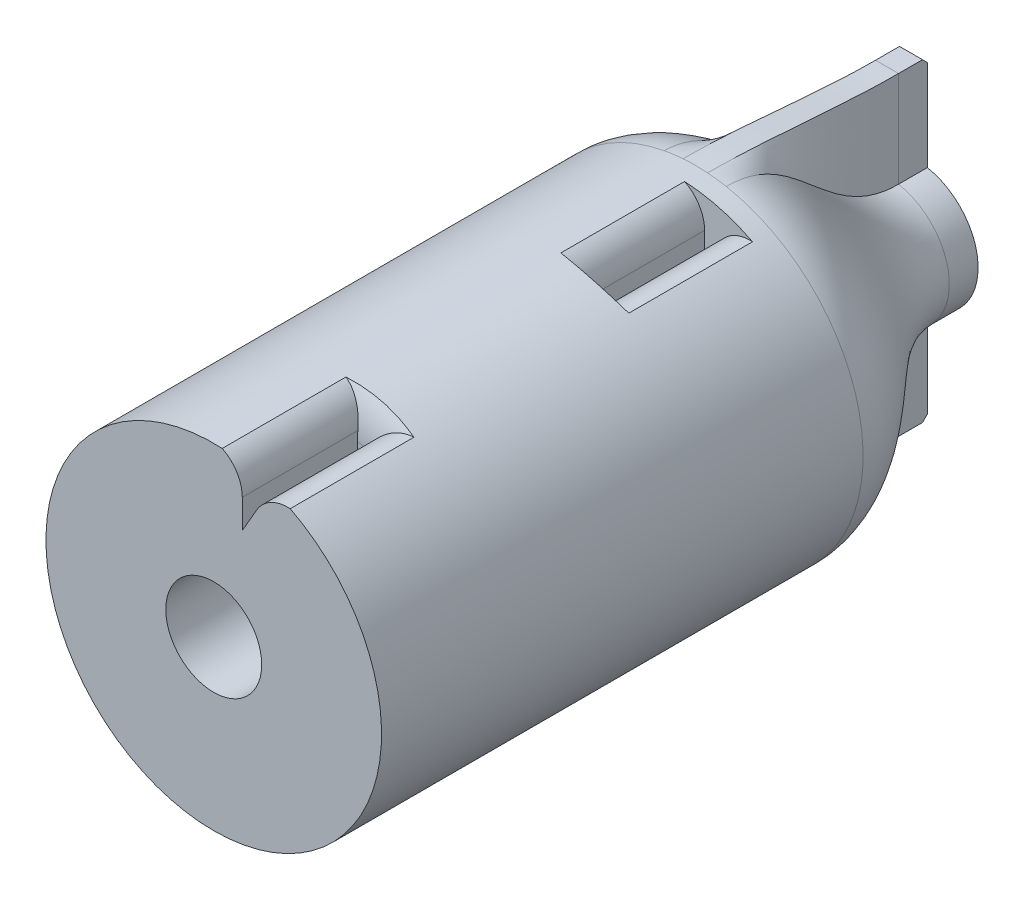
ISO-10303-21;
HEADER;
FILE_DESCRIPTION(('STEP AP214'),'2;1');
FILE_NAME('part.step','',(''),(''),'','','');
FILE_SCHEMA(('AUTOMOTIVE_DESIGN { 1 0 10303 214 1 1 1 1 }'));
ENDSEC;
DATA;
#1=APPLICATION_CONTEXT('core data for automotive mechanical design processes');
#2=APPLICATION_PROTOCOL_DEFINITION('international standard','automotive_design',2000,#1);
#3=PRODUCT_CONTEXT('',#1,'mechanical');
#4=PRODUCT('Part','Part','',(#3));
#5=PRODUCT_RELATED_PRODUCT_CATEGORY('part','',(#4));
#6=PRODUCT_DEFINITION_FORMATION('','',#4);
#7=PRODUCT_DEFINITION_CONTEXT('part definition',#1,'design');
#8=PRODUCT_DEFINITION('design','',#6,#7);
#9=PRODUCT_DEFINITION_SHAPE('','',#8);
#10=(LENGTH_UNIT() NAMED_UNIT(*) SI_UNIT(.MILLI.,.METRE.));
#11=(NAMED_UNIT(*) PLANE_ANGLE_UNIT() SI_UNIT($,.RADIAN.));
#12=(NAMED_UNIT(*) SI_UNIT($,.STERADIAN.) SOLID_ANGLE_UNIT());
#13=UNCERTAINTY_MEASURE_WITH_UNIT(LENGTH_MEASURE(1.E-05),#10,'distance_accuracy_value','');
#14=(GEOMETRIC_REPRESENTATION_CONTEXT(3) GLOBAL_UNCERTAINTY_ASSIGNED_CONTEXT((#13)) GLOBAL_UNIT_ASSIGNED_CONTEXT((#10,
#11,#12)) REPRESENTATION_CONTEXT('',''));
#15=CARTESIAN_POINT('',(0.,0.,0.));
#16=DIRECTION('',(0.,0.,1.));
#17=DIRECTION('',(1.,0.,0.));
#18=AXIS2_PLACEMENT_3D('',#15,#16,#17);
#19=CARTESIAN_POINT('',(-46.9561399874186,36.6857906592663,-97.7174746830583));
#20=DIRECTION('',(0.,0.,1.));
#21=DIRECTION('',(1.,0.,0.));
#22=AXIS2_PLACEMENT_3D('',#19,#20,#21);
#23=CYLINDRICAL_SURFACE('',#22,17.5);
#24=CARTESIAN_POINT('',(-46.0710828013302,54.1633955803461,-35.3161930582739));
#25=CARTESIAN_POINT('',(-45.9167768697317,54.1555813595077,-35.2988944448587));
#26=CARTESIAN_POINT('',(-45.7624960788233,54.1457199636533,-35.2823608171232));
#27=CARTESIAN_POINT('',(-45.454068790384,54.1218943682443,-35.251026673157));
#28=CARTESIAN_POINT('',(-45.2999222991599,54.1079299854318,-35.2362262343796));
#29=CARTESIAN_POINT('',(-44.837783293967,54.0598660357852,-35.1947273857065));
#30=CARTESIAN_POINT('',(-44.5301390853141,54.0195980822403,-35.1709369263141));
#31=CARTESIAN_POINT('',(-43.9213515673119,53.9233557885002,-35.1327139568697));
#32=CARTESIAN_POINT('',(-43.620178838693,53.8676187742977,-35.1181501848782));
#33=CARTESIAN_POINT('',(-43.020911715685,53.7403438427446,-35.0986406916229));
#34=CARTESIAN_POINT('',(-42.7228168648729,53.6688083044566,-35.0936935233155));
#35=CARTESIAN_POINT('',(-42.1307965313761,53.5101769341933,-35.0936935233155));
#36=CARTESIAN_POINT('',(-41.8368710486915,53.423081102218,-35.0986406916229));
#37=CARTESIAN_POINT('',(-41.2542530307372,53.233670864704,-35.1181501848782));
#38=CARTESIAN_POINT('',(-40.9655612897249,53.131354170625,-35.1327139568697));
#39=CARTESIAN_POINT('',(-40.3902146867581,52.9103086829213,-35.1709369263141));
#40=CARTESIAN_POINT('',(-40.103653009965,52.7913596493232,-35.1947273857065));
#41=CARTESIAN_POINT('',(-39.679396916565,52.6019147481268,-35.2362262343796));
#42=CARTESIAN_POINT('',(-39.5389199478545,52.5369350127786,-35.251026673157));
#43=CARTESIAN_POINT('',(-39.2599012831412,52.4033549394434,-35.2823608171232));
#44=CARTESIAN_POINT('',(-39.1213595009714,52.3347547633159,-35.2988944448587));
#45=CARTESIAN_POINT('',(-38.9838195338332,52.2643691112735,-35.3161930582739));
#46=B_SPLINE_CURVE_WITH_KNOTS('',3,(#24,#25,#26,#27,#28,#29,#30,#31,#32,#33,#34,#35,#36,#37,#38,
#39,#40,#41,#42,#43,#44,#45),.UNSPECIFIED.,.F.,.F.,(4,2,2,2,2,2,2,2,2,2,4),(0.,
0.466376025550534,0.932772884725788,1.86571101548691,2.78505979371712,3.7042702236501,
4.62348065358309,5.54282943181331,6.47576756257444,6.94216442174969,7.40854044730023),.UNSPECIFIED.);
#47=CARTESIAN_POINT('',(-46.0710828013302,54.1633955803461,-35.3161930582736));
#48=VERTEX_POINT('',#47);
#49=CARTESIAN_POINT('',(-38.9838195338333,52.2643691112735,-35.3161930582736));
#50=VERTEX_POINT('',#49);
#51=EDGE_CURVE('E922',#48,#50,#46,.T.);
#52=ORIENTED_EDGE('',*,*,#51,.F.);
#53=DIRECTION('',(0.,0.,-1.));
#54=VECTOR('',#53,1.);
#55=CARTESIAN_POINT('',(-46.0710828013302,54.1633955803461,-36.22));
#56=LINE('',#55,#54);
#57=CARTESIAN_POINT('',(-46.0710828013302,54.1633955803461,-48.22));
#58=VERTEX_POINT('',#57);
#59=EDGE_CURVE('E1594',#48,#58,#56,.T.);
#60=ORIENTED_EDGE('',*,*,#59,.T.);
#61=CARTESIAN_POINT('',(-46.9561399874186,36.6857906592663,-48.22));
#62=DIRECTION('',(0.,0.,-1.));
#63=DIRECTION('',(-1.,0.,0.));
#64=AXIS2_PLACEMENT_3D('',#61,#62,#63);
#65=CIRCLE('',#64,17.5);
#66=CARTESIAN_POINT('',(-38.9838195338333,52.2643691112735,-48.22));
#67=VERTEX_POINT('',#66);
#68=EDGE_CURVE('E788',#58,#67,#65,.T.);
#69=ORIENTED_EDGE('',*,*,#68,.T.);
#70=DIRECTION('',(0.,0.,-1.));
#71=VECTOR('',#70,1.);
#72=CARTESIAN_POINT('',(-38.9838195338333,52.2643691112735,-36.22));
#73=LINE('',#72,#71);
#74=EDGE_CURVE('E1601',#50,#67,#73,.T.);
#75=ORIENTED_EDGE('',*,*,#74,.F.);
#76=EDGE_LOOP('',(#52,#60,#69,#75));
#77=FACE_BOUND('',#76,.T.);
#78=DIRECTION('',(0.,0.,1.));
#79=VECTOR('',#78,1.);
#80=CARTESIAN_POINT('',(-46.0710828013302,54.1633955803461,-12.));
#81=LINE('',#80,#79);
#82=CARTESIAN_POINT('',(-46.0710828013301,54.1633955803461,-12.9038069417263));
#83=VERTEX_POINT('',#82);
#84=CARTESIAN_POINT('',(-46.0710828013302,54.1633955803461,0.));
#85=VERTEX_POINT('',#84);
#86=EDGE_CURVE('E1573',#83,#85,#81,.T.);
#87=ORIENTED_EDGE('',*,*,#86,.F.);
#88=CARTESIAN_POINT('',(-46.0710828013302,54.1633955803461,-12.9038069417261));
#89=CARTESIAN_POINT('',(-45.9167768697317,54.1555813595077,-12.9211055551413));
#90=CARTESIAN_POINT('',(-45.7624960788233,54.1457199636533,-12.9376391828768));
#91=CARTESIAN_POINT('',(-45.454068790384,54.1218943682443,-12.968973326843));
#92=CARTESIAN_POINT('',(-45.2999222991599,54.1079299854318,-12.9837737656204));
#93=CARTESIAN_POINT('',(-44.837783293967,54.0598660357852,-13.0252726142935));
#94=CARTESIAN_POINT('',(-44.5301390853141,54.0195980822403,-13.0490630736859));
#95=CARTESIAN_POINT('',(-43.9213515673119,53.9233557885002,-13.0872860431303));
#96=CARTESIAN_POINT('',(-43.620178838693,53.8676187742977,-13.1018498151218));
#97=CARTESIAN_POINT('',(-43.0209117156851,53.7403438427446,-13.1213593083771));
#98=CARTESIAN_POINT('',(-42.7228168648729,53.6688083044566,-13.1263064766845));
#99=CARTESIAN_POINT('',(-42.1307965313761,53.5101769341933,-13.1263064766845));
#100=CARTESIAN_POINT('',(-41.8368710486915,53.423081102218,-13.1213593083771));
#101=CARTESIAN_POINT('',(-41.2542530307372,53.233670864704,-13.1018498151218));
#102=CARTESIAN_POINT('',(-40.9655612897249,53.131354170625,-13.0872860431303));
#103=CARTESIAN_POINT('',(-40.3902146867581,52.9103086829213,-13.0490630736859));
#104=CARTESIAN_POINT('',(-40.103653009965,52.7913596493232,-13.0252726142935));
#105=CARTESIAN_POINT('',(-39.679396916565,52.6019147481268,-12.9837737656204));
#106=CARTESIAN_POINT('',(-39.5389199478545,52.5369350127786,-12.968973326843));
#107=CARTESIAN_POINT('',(-39.2599012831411,52.4033549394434,-12.9376391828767));
#108=CARTESIAN_POINT('',(-39.1213595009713,52.3347547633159,-12.9211055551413));
#109=CARTESIAN_POINT('',(-38.9838195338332,52.2643691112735,-12.9038069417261));
#110=B_SPLINE_CURVE_WITH_KNOTS('',3,(#88,#89,#90,#91,#92,#93,#94,#95,#96,#97,#98,#99,#100,#101,
#102,#103,#104,#105,#106,#107,#108,#109),.UNSPECIFIED.,.F.,.F.,(4,2,2,2,2,2,2,2,2,2,4),(0.,
0.466376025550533,0.932772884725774,1.86571101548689,2.78505979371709,3.70427022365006,
4.62348065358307,5.54282943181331,6.47576756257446,6.94216442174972,7.40854044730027),.UNSPECIFIED.);
#111=CARTESIAN_POINT('',(-38.9838195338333,52.2643691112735,-12.9038069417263));
#112=VERTEX_POINT('',#111);
#113=EDGE_CURVE('E932',#83,#112,#110,.T.);
#114=ORIENTED_EDGE('',*,*,#113,.T.);
#115=DIRECTION('',(0.,0.,1.));
#116=VECTOR('',#115,1.);
#117=CARTESIAN_POINT('',(-38.9838195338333,52.2643691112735,-12.));
#118=LINE('',#117,#116);
#119=CARTESIAN_POINT('',(-38.9838195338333,52.2643691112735,0.));
#120=VERTEX_POINT('',#119);
#121=EDGE_CURVE('E1576',#112,#120,#118,.T.);
#122=ORIENTED_EDGE('',*,*,#121,.T.);
#123=CARTESIAN_POINT('',(-46.9561399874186,36.6857906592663,0.));
#124=DIRECTION('',(0.,0.,1.));
#125=DIRECTION('',(1.,0.,0.));
#126=AXIS2_PLACEMENT_3D('',#123,#124,#125);
#127=CIRCLE('',#126,17.5);
#128=EDGE_CURVE('E1602',#85,#120,#127,.T.);
#129=ORIENTED_EDGE('',*,*,#128,.F.);
#130=EDGE_LOOP('',(#87,#114,#122,#129));
#131=FACE_BOUND('',#130,.T.);
#132=CARTESIAN_POINT('',(-54.0392157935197,20.6832896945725,-28.7583515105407));
#133=CARTESIAN_POINT('',(-52.0070669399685,19.7838137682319,-28.7583515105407));
#134=CARTESIAN_POINT('',(-49.8029526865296,19.2765182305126,-28.7583515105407));
#135=CARTESIAN_POINT('',(-45.3618780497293,19.11748288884,-28.7583515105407));
#136=CARTESIAN_POINT('',(-43.1267895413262,19.4659421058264,-28.7583515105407));
#137=CARTESIAN_POINT('',(-40.5228774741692,20.4020480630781,-28.7583515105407));
#138=CARTESIAN_POINT('',(-40.0185367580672,20.610443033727,-28.7583515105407));
#139=CARTESIAN_POINT('',(-39.5250177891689,20.8419141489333,-28.7583515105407));
#140=(BOUNDED_CURVE() B_SPLINE_CURVE(3,(#132,#133,#134,#135,#136,#137,#138,#139),.UNSPECIFIED.,
.F.,.F.) B_SPLINE_CURVE_WITH_KNOTS((4,2,2,4),(4.27382967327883,4.65473721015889,
5.03564474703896,5.12909132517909),
.UNSPECIFIED.) CURVE() GEOMETRIC_REPRESENTATION_ITEM() RATIONAL_B_SPLINE_CURVE((1.,1.,1.,1.,1.,
1.,1.,1.)) REPRESENTATION_ITEM(''));
#141=CARTESIAN_POINT('',(-41.0358416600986,20.217637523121,-28.7583515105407));
#142=VERTEX_POINT('',#141);
#143=CARTESIAN_POINT('',(-53.4118777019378,20.4201409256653,-28.7583515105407));
#144=VERTEX_POINT('',#143);
#145=EDGE_CURVE('E877',#142,#144,#140,.F.);
#146=ORIENTED_EDGE('',*,*,#145,.T.);
#147=DIRECTION('',(0.,0.,-1.));
#148=VECTOR('',#147,1.);
#149=CARTESIAN_POINT('',(-53.4119151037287,20.4200915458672,-21.4583515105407));
#150=LINE('',#149,#148);
#151=CARTESIAN_POINT('',(-53.4118931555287,20.4201469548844,-19.4583515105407));
#152=VERTEX_POINT('',#151);
#153=EDGE_CURVE('E1652',#152,#144,#150,.T.);
#154=ORIENTED_EDGE('',*,*,#153,.F.);
#155=CARTESIAN_POINT('',(-39.5250177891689,20.8419141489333,-19.4583515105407));
#156=CARTESIAN_POINT('',(-40.0185367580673,20.6104430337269,-19.4583515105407));
#157=CARTESIAN_POINT('',(-40.5228774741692,20.4020480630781,-19.4583515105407));
#158=CARTESIAN_POINT('',(-43.1267895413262,19.4659421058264,-19.4583515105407));
#159=CARTESIAN_POINT('',(-45.3618780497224,19.1174828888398,-19.4583515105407));
#160=CARTESIAN_POINT('',(-49.8029526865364,19.2765182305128,-19.4583515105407));
#161=CARTESIAN_POINT('',(-52.0070669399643,19.78381376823,-19.4583515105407));
#162=CARTESIAN_POINT('',(-54.0392157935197,20.6832896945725,-19.4583515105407));
#163=(BOUNDED_CURVE() B_SPLINE_CURVE(3,(#155,#156,#157,#158,#159,#160,#161,#162),.UNSPECIFIED.,
.F.,.F.) B_SPLINE_CURVE_WITH_KNOTS((4,2,2,4),(4.29568663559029,4.38913321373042,
4.77004075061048,5.15094828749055),
.UNSPECIFIED.) CURVE() GEOMETRIC_REPRESENTATION_ITEM() RATIONAL_B_SPLINE_CURVE((1.,1.,1.,1.,1.,
1.,1.,1.)) REPRESENTATION_ITEM(''));
#164=CARTESIAN_POINT('',(-41.0358416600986,20.217637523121,-19.4583515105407));
#165=VERTEX_POINT('',#164);
#166=EDGE_CURVE('E1692',#152,#165,#163,.F.);
#167=ORIENTED_EDGE('',*,*,#166,.T.);
#168=DIRECTION('',(0.,0.,1.));
#169=VECTOR('',#168,1.);
#170=CARTESIAN_POINT('',(-41.0358416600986,20.217637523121,-97.7174746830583));
#171=LINE('',#170,#169);
#172=CARTESIAN_POINT('',(-41.0358416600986,20.217637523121,-24.1083515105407));
#173=VERTEX_POINT('',#172);
#174=EDGE_CURVE('E1604',#165,#173,#171,.F.);
#175=ORIENTED_EDGE('',*,*,#174,.T.);
#176=DIRECTION('',(0.,0.,1.));
#177=VECTOR('',#176,1.);
#178=CARTESIAN_POINT('',(-41.0358416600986,20.217637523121,-97.7174746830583));
#179=LINE('',#178,#177);
#180=EDGE_CURVE('E882',#173,#142,#179,.F.);
#181=ORIENTED_EDGE('',*,*,#180,.T.);
#182=EDGE_LOOP('',(#146,#154,#167,#175,#181));
#183=FACE_BOUND('',#182,.T.);
#184=CARTESIAN_POINT('',(-43.7253707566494,19.4866008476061,-50.22));
#185=CARTESIAN_POINT('',(-44.3713802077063,19.3652516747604,-50.22));
#186=CARTESIAN_POINT('',(-45.0226042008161,19.2805186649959,-50.22));
#187=CARTESIAN_POINT('',(-45.678157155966,19.2325170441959,-50.22));
#188=B_SPLINE_CURVE_WITH_KNOTS('',3,(#184,#185,#186,#187),.UNSPECIFIED.,.F.,.F.,(4,4),(0.,1.),.UNSPECIFIED.);
#189=CARTESIAN_POINT('',(-43.7253707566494,19.4866008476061,-50.22));
#190=VERTEX_POINT('',#189);
#191=CARTESIAN_POINT('',(-45.6781509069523,19.2324312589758,-50.22));
#192=VERTEX_POINT('',#191);
#193=EDGE_CURVE('E773',#190,#192,#188,.T.);
#194=ORIENTED_EDGE('',*,*,#193,.F.);
#195=CARTESIAN_POINT('',(-46.9561399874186,36.6857906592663,-50.22));
#196=DIRECTION('',(0.,0.,-1.));
#197=DIRECTION('',(-1.,0.,0.));
#198=AXIS2_PLACEMENT_3D('',#195,#196,#197);
#199=CIRCLE('',#198,17.5);
#200=CARTESIAN_POINT('',(-43.7253703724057,53.8849824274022,-50.22));
#201=VERTEX_POINT('',#200);
#202=EDGE_CURVE('E844',#201,#190,#199,.T.);
#203=ORIENTED_EDGE('',*,*,#202,.F.);
#204=CARTESIAN_POINT('',(-45.6781504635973,54.1391560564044,-50.22));
#205=VERTEX_POINT('',#204);
#206=EDGE_CURVE('E852',#205,#201,#199,.T.);
#207=ORIENTED_EDGE('',*,*,#206,.F.);
#208=CARTESIAN_POINT('',(-48.234129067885,54.1391500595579,-50.22));
#209=VERTEX_POINT('',#208);
#210=EDGE_CURVE('E850',#209,#205,#199,.T.);
#211=ORIENTED_EDGE('',*,*,#210,.F.);
#212=CARTESIAN_POINT('',(-50.186910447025,53.8849869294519,-50.22));
#213=VERTEX_POINT('',#212);
#214=EDGE_CURVE('E649',#213,#209,#199,.T.);
#215=ORIENTED_EDGE('',*,*,#214,.F.);
#216=CARTESIAN_POINT('',(-50.1869096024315,19.4865988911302,-50.22));
#217=VERTEX_POINT('',#216);
#218=EDGE_CURVE('E593',#217,#213,#199,.T.);
#219=ORIENTED_EDGE('',*,*,#218,.F.);
#220=CARTESIAN_POINT('',(-48.23412951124,19.2324252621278,-50.22));
#221=VERTEX_POINT('',#220);
#222=EDGE_CURVE('E595',#221,#217,#199,.T.);
#223=ORIENTED_EDGE('',*,*,#222,.F.);
#224=EDGE_CURVE('E847',#192,#221,#199,.T.);
#225=ORIENTED_EDGE('',*,*,#224,.F.);
#226=EDGE_LOOP('',(#194,#203,#207,#211,#215,#219,#223,#225));
#227=FACE_BOUND('',#226,.T.);
#228=ADVANCED_FACE('F197',(#77,#131,#183,#227),#23,.T.);
#229=CARTESIAN_POINT('',(-47.7397209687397,50.7939376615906,-12.));
#230=DIRECTION('',(0.,0.,-1.));
#231=DIRECTION('',(1.,0.,0.));
#232=AXIS2_PLACEMENT_3D('',#229,#230,#231);
#233=PLANE('',#232);
#234=DIRECTION('',(-0.965925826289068,0.258819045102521,0.));
#235=VECTOR('',#234,1.);
#236=CARTESIAN_POINT('',(-41.9442598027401,49.3190898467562,-12.));
#237=LINE('',#236,#235);
#238=CARTESIAN_POINT('',(-42.9444447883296,49.5870886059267,-12.));
#239=VERTEX_POINT('',#238);
#240=CARTESIAN_POINT('',(-43.9797209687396,49.8644900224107,-12.));
#241=VERTEX_POINT('',#240);
#242=EDGE_CURVE('E1544',#239,#241,#237,.T.);
#243=ORIENTED_EDGE('',*,*,#242,.T.);
#244=DIRECTION('',(0.,1.,0.));
#245=VECTOR('',#244,1.);
#246=CARTESIAN_POINT('',(-43.9797209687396,50.7939376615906,-12.));
#247=LINE('',#246,#245);
#248=CARTESIAN_POINT('',(-43.9797209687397,47.7939376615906,-12.));
#249=VERTEX_POINT('',#248);
#250=EDGE_CURVE('E1556',#249,#241,#247,.T.);
#251=ORIENTED_EDGE('',*,*,#250,.F.);
#252=DIRECTION('',(-0.499999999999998,-0.86602540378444,0.));
#253=VECTOR('',#252,1.);
#254=CARTESIAN_POINT('',(-42.4797209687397,50.3920138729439,-12.));
#255=LINE('',#254,#253);
#256=EDGE_CURVE('E1559',#239,#249,#255,.T.);
#257=ORIENTED_EDGE('',*,*,#256,.F.);
#258=EDGE_LOOP('',(#243,#251,#257));
#259=FACE_BOUND('',#258,.T.);
#260=ADVANCED_FACE('F913',(#259),#233,.F.);
#261=CARTESIAN_POINT('',(0.,0.,0.));
#262=DIRECTION('',(0.,0.,1.));
#263=DIRECTION('',(1.,0.,0.));
#264=AXIS2_PLACEMENT_3D('',#261,#262,#263);
#265=PLANE('',#264);
#266=CARTESIAN_POINT('',(-46.9561399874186,36.6857906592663,0.));
#267=DIRECTION('',(0.,0.,1.));
#268=DIRECTION('',(1.,0.,0.));
#269=AXIS2_PLACEMENT_3D('',#266,#267,#268);
#270=CIRCLE('',#269,5.);
#271=CARTESIAN_POINT('',(-41.9561399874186,36.6857906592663,0.));
#272=VERTEX_POINT('',#271);
#273=EDGE_CURVE('E958',#272,#272,#270,.T.);
#274=ORIENTED_EDGE('',*,*,#273,.F.);
#275=EDGE_LOOP('',(#274));
#276=FACE_BOUND('',#275,.T.);
#277=DIRECTION('',(0.,1.,0.));
#278=VECTOR('',#277,1.);
#279=CARTESIAN_POINT('',(-43.9797209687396,50.7939376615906,0.));
#280=LINE('',#279,#278);
#281=CARTESIAN_POINT('',(-43.9797209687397,47.7939376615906,0.));
#282=VERTEX_POINT('',#281);
#283=CARTESIAN_POINT('',(-43.9797209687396,50.7939376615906,0.));
#284=VERTEX_POINT('',#283);
#285=EDGE_CURVE('E1565',#282,#284,#280,.T.);
#286=ORIENTED_EDGE('',*,*,#285,.T.);
#287=CARTESIAN_POINT('',(-47.7397209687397,50.7939376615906,0.));
#288=DIRECTION('',(0.,0.,1.));
#289=DIRECTION('',(1.,0.,0.));
#290=AXIS2_PLACEMENT_3D('',#287,#288,#289);
#291=CIRCLE('',#290,3.76);
#292=EDGE_CURVE('E1554',#284,#85,#291,.T.);
#293=ORIENTED_EDGE('',*,*,#292,.T.);
#294=ORIENTED_EDGE('',*,*,#128,.T.);
#295=CARTESIAN_POINT('',(-39.2234654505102,48.5120138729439,0.));
#296=DIRECTION('',(0.,0.,1.));
#297=DIRECTION('',(-1.,0.,0.));
#298=AXIS2_PLACEMENT_3D('',#295,#296,#297);
#299=CIRCLE('',#298,3.76);
#300=CARTESIAN_POINT('',(-42.4797209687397,50.3920138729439,0.));
#301=VERTEX_POINT('',#300);
#302=EDGE_CURVE('E1560',#120,#301,#299,.T.);
#303=ORIENTED_EDGE('',*,*,#302,.T.);
#304=DIRECTION('',(-0.499999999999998,-0.86602540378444,0.));
#305=VECTOR('',#304,1.);
#306=CARTESIAN_POINT('',(-42.4797209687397,50.3920138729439,0.));
#307=LINE('',#306,#305);
#308=EDGE_CURVE('E1568',#301,#282,#307,.T.);
#309=ORIENTED_EDGE('',*,*,#308,.T.);
#310=EDGE_LOOP('',(#286,#293,#294,#303,#309));
#311=FACE_BOUND('',#310,.T.);
#312=ADVANCED_FACE('F915',(#276,#311),#265,.T.);
#313=CARTESIAN_POINT('',(-47.7397209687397,50.7939376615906,-36.22));
#314=DIRECTION('',(0.,0.,1.));
#315=DIRECTION('',(1.,0.,0.));
#316=AXIS2_PLACEMENT_3D('',#313,#314,#315);
#317=PLANE('',#316);
#318=DIRECTION('',(0.,1.,0.));
#319=VECTOR('',#318,1.);
#320=CARTESIAN_POINT('',(-43.9797209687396,50.7939376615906,-36.22));
#321=LINE('',#320,#319);
#322=CARTESIAN_POINT('',(-43.9797209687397,47.7939376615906,-36.22));
#323=VERTEX_POINT('',#322);
#324=CARTESIAN_POINT('',(-43.9797209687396,49.8644900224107,-36.22));
#325=VERTEX_POINT('',#324);
#326=EDGE_CURVE('E1612',#323,#325,#321,.T.);
#327=ORIENTED_EDGE('',*,*,#326,.T.);
#328=DIRECTION('',(-0.965925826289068,0.258819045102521,0.));
#329=VECTOR('',#328,1.);
#330=CARTESIAN_POINT('',(-41.9442598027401,49.3190898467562,-36.22));
#331=LINE('',#330,#329);
#332=CARTESIAN_POINT('',(-42.9444447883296,49.5870886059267,-36.22));
#333=VERTEX_POINT('',#332);
#334=EDGE_CURVE('E1630',#333,#325,#331,.T.);
#335=ORIENTED_EDGE('',*,*,#334,.F.);
#336=DIRECTION('',(-0.499999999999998,-0.86602540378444,0.));
#337=VECTOR('',#336,1.);
#338=CARTESIAN_POINT('',(-42.4797209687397,50.3920138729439,-36.22));
#339=LINE('',#338,#337);
#340=EDGE_CURVE('E1621',#333,#323,#339,.T.);
#341=ORIENTED_EDGE('',*,*,#340,.T.);
#342=EDGE_LOOP('',(#327,#335,#341));
#343=FACE_BOUND('',#342,.T.);
#344=ADVANCED_FACE('F1334',(#343),#317,.F.);
#345=CARTESIAN_POINT('',(-47.7397209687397,50.7939376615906,-36.22));
#346=DIRECTION('',(0.,0.,-1.));
#347=DIRECTION('',(-1.,0.,0.));
#348=AXIS2_PLACEMENT_3D('',#345,#346,#347);
#349=CYLINDRICAL_SURFACE('',#348,3.76);
#350=CARTESIAN_POINT('',(-47.7397209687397,50.7939376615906,-48.22));
#351=DIRECTION('',(0.,0.,1.));
#352=DIRECTION('',(1.,0.,0.));
#353=AXIS2_PLACEMENT_3D('',#350,#351,#352);
#354=CIRCLE('',#353,3.76);
#355=CARTESIAN_POINT('',(-43.9797209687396,50.7939376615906,-48.22));
#356=VERTEX_POINT('',#355);
#357=EDGE_CURVE('E1628',#356,#58,#354,.T.);
#358=ORIENTED_EDGE('',*,*,#357,.T.);
#359=ORIENTED_EDGE('',*,*,#59,.F.);
#360=CARTESIAN_POINT('',(-46.0710828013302,54.1633955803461,-35.3161930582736));
#361=CARTESIAN_POINT('',(-45.9768984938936,54.1167666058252,-35.3272139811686));
#362=CARTESIAN_POINT('',(-45.8849195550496,54.0662867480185,-35.3404320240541));
#363=CARTESIAN_POINT('',(-45.7060028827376,53.9581883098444,-35.3706522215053));
#364=CARTESIAN_POINT('',(-45.6190613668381,53.9005751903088,-35.3876514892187));
#365=CARTESIAN_POINT('',(-45.4510466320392,53.7789480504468,-35.4247671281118));
#366=CARTESIAN_POINT('',(-45.3699510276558,53.7149609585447,-35.4448705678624));
#367=CARTESIAN_POINT('',(-45.2136640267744,53.5809156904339,-35.4875671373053));
#368=CARTESIAN_POINT('',(-45.1384737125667,53.5108564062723,-35.5101607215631));
#369=CARTESIAN_POINT('',(-44.9227221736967,53.2926992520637,-35.5805119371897));
#370=CARTESIAN_POINT('',(-44.7913714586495,53.1361782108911,-35.6309831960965));
#371=CARTESIAN_POINT('',(-44.5557171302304,52.8042415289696,-35.733715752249));
#372=CARTESIAN_POINT('',(-44.4514629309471,52.6287921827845,-35.7859801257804));
#373=CARTESIAN_POINT('',(-44.2663924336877,52.2502092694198,-35.8904352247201));
#374=CARTESIAN_POINT('',(-44.1875772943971,52.0460127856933,-35.9423934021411));
#375=CARTESIAN_POINT('',(-44.096642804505,51.7307222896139,-36.0129279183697));
#376=CARTESIAN_POINT('',(-44.0708877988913,51.6242034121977,-36.0351927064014));
#377=CARTESIAN_POINT('',(-44.02870997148,51.4087670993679,-36.0766524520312));
#378=CARTESIAN_POINT('',(-44.0122810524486,51.299851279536,-36.0958494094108));
#379=CARTESIAN_POINT('',(-43.9937004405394,51.1245310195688,-36.1236046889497));
#380=CARTESIAN_POINT('',(-43.9884646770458,51.0586216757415,-36.1333391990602));
#381=CARTESIAN_POINT('',(-43.9814762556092,50.9264874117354,-36.1513839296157));
#382=CARTESIAN_POINT('',(-43.9797203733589,50.8602628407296,-36.159695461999));
#383=CARTESIAN_POINT('',(-43.9797209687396,50.7939376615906,-36.1672485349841));
#384=B_SPLINE_CURVE_WITH_KNOTS('',3,(#360,#361,#362,#363,#364,#365,#366,#367,#368,#369,#370,
#371,#372,#373,#374,#375,#376,#377,#378,#379,#380,#381,#382,#383),.UNSPECIFIED.,.F.,.F.,(4,2,2,
2,2,2,2,2,2,2,2,4),(0.,0.316843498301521,0.633445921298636,0.948763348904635,1.26413843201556,
1.89261518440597,2.52223013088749,3.19340179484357,3.52852151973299,3.86342189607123,
4.06381552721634,4.26402339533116),.UNSPECIFIED.);
#385=CARTESIAN_POINT('',(-43.9797209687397,50.7939376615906,-36.1672485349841));
#386=VERTEX_POINT('',#385);
#387=EDGE_CURVE('E1518',#48,#386,#384,.T.);
#388=ORIENTED_EDGE('',*,*,#387,.T.);
#389=DIRECTION('',(0.,0.,-1.));
#390=VECTOR('',#389,1.);
#391=CARTESIAN_POINT('',(-43.9797209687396,50.7939376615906,-36.22));
#392=LINE('',#391,#390);
#393=EDGE_CURVE('E1591',#386,#356,#392,.T.);
#394=ORIENTED_EDGE('',*,*,#393,.T.);
#395=EDGE_LOOP('',(#358,#359,#388,#394));
#396=FACE_BOUND('',#395,.T.);
#397=ADVANCED_FACE('F1323',(#396),#349,.T.);
#398=CARTESIAN_POINT('',(-43.9797209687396,50.7939376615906,-36.22));
#399=DIRECTION('',(-1.,0.,0.));
#400=DIRECTION('',(0.,-1.,0.));
#401=AXIS2_PLACEMENT_3D('',#398,#399,#400);
#402=PLANE('',#401);
#403=DIRECTION('',(0.,1.,0.));
#404=VECTOR('',#403,1.);
#405=CARTESIAN_POINT('',(-43.9797209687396,50.7939376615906,-48.22));
#406=LINE('',#405,#404);
#407=CARTESIAN_POINT('',(-43.9797209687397,47.7939376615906,-48.22));
#408=VERTEX_POINT('',#407);
#409=EDGE_CURVE('E1619',#408,#356,#406,.T.);
#410=ORIENTED_EDGE('',*,*,#409,.T.);
#411=ORIENTED_EDGE('',*,*,#393,.F.);
#412=CARTESIAN_POINT('',(-43.9797209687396,49.8644900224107,-28.5539842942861));
#413=DIRECTION('',(-1.,0.,0.));
#414=DIRECTION('',(0.,-1.,0.));
#415=AXIS2_PLACEMENT_3D('',#412,#413,#414);
#416=ELLIPSE('',#415,7.93644345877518,7.66601570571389);
#417=EDGE_CURVE('E1575',#386,#325,#416,.T.);
#418=ORIENTED_EDGE('',*,*,#417,.T.);
#419=ORIENTED_EDGE('',*,*,#326,.F.);
#420=DIRECTION('',(0.,0.,-1.));
#421=VECTOR('',#420,1.);
#422=CARTESIAN_POINT('',(-43.9797209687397,47.7939376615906,-36.22));
#423=LINE('',#422,#421);
#424=EDGE_CURVE('E1608',#323,#408,#423,.T.);
#425=ORIENTED_EDGE('',*,*,#424,.T.);
#426=EDGE_LOOP('',(#410,#411,#418,#419,#425));
#427=FACE_BOUND('',#426,.T.);
#428=ADVANCED_FACE('F1313',(#427),#402,.F.);
#429=CARTESIAN_POINT('',(-42.4797209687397,50.3920138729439,-36.22));
#430=DIRECTION('',(0.86602540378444,-0.499999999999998,0.));
#431=DIRECTION('',(0.499999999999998,0.86602540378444,0.));
#432=AXIS2_PLACEMENT_3D('',#429,#430,#431);
#433=PLANE('',#432);
#434=DIRECTION('',(-0.499999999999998,-0.86602540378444,0.));
#435=VECTOR('',#434,1.);
#436=CARTESIAN_POINT('',(-42.4797209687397,50.3920138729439,-48.22));
#437=LINE('',#436,#435);
#438=CARTESIAN_POINT('',(-42.4797209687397,50.3920138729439,-48.22));
#439=VERTEX_POINT('',#438);
#440=EDGE_CURVE('E1622',#439,#408,#437,.T.);
#441=ORIENTED_EDGE('',*,*,#440,.T.);
#442=ORIENTED_EDGE('',*,*,#424,.F.);
#443=ORIENTED_EDGE('',*,*,#340,.F.);
#444=CARTESIAN_POINT('',(-42.9444447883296,49.5870886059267,-28.5539842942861));
#445=DIRECTION('',(0.86602540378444,-0.499999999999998,0.));
#446=DIRECTION('',(-0.499999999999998,-0.86602540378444,0.));
#447=AXIS2_PLACEMENT_3D('',#444,#445,#446);
#448=ELLIPSE('',#447,7.93644345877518,7.66601570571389);
#449=CARTESIAN_POINT('',(-42.4797209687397,50.3920138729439,-36.1672485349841));
#450=VERTEX_POINT('',#449);
#451=EDGE_CURVE('E1517',#333,#450,#448,.T.);
#452=ORIENTED_EDGE('',*,*,#451,.T.);
#453=DIRECTION('',(0.,0.,-1.));
#454=VECTOR('',#453,1.);
#455=CARTESIAN_POINT('',(-42.4797209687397,50.3920138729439,-36.22));
#456=LINE('',#455,#454);
#457=EDGE_CURVE('E1614',#450,#439,#456,.T.);
#458=ORIENTED_EDGE('',*,*,#457,.T.);
#459=EDGE_LOOP('',(#441,#442,#443,#452,#458));
#460=FACE_BOUND('',#459,.T.);
#461=ADVANCED_FACE('F1302',(#460),#433,.F.);
#462=CARTESIAN_POINT('',(-39.2234654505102,48.5120138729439,-36.22));
#463=DIRECTION('',(0.,0.,-1.));
#464=DIRECTION('',(-1.,0.,0.));
#465=AXIS2_PLACEMENT_3D('',#462,#463,#464);
#466=CYLINDRICAL_SURFACE('',#465,3.76);
#467=CARTESIAN_POINT('',(-39.2234654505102,48.5120138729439,-48.22));
#468=DIRECTION('',(0.,0.,1.));
#469=DIRECTION('',(-1.,0.,0.));
#470=AXIS2_PLACEMENT_3D('',#467,#468,#469);
#471=CIRCLE('',#470,3.76);
#472=EDGE_CURVE('E1625',#67,#439,#471,.T.);
#473=ORIENTED_EDGE('',*,*,#472,.T.);
#474=ORIENTED_EDGE('',*,*,#457,.F.);
#475=CARTESIAN_POINT('',(-42.4797209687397,50.3920138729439,-36.1672485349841));
#476=CARTESIAN_POINT('',(-42.4269340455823,50.483467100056,-36.1552359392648));
#477=CARTESIAN_POINT('',(-42.3704001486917,50.5724678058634,-36.1412796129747));
#478=CARTESIAN_POINT('',(-42.250427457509,50.7449734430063,-36.1099616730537));
#479=CARTESIAN_POINT('',(-42.1869929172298,50.8284817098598,-36.0926021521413));
#480=CARTESIAN_POINT('',(-42.0540093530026,50.9892019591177,-36.0550196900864));
#481=CARTESIAN_POINT('',(-41.9844858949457,51.0664378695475,-36.0348085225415));
#482=CARTESIAN_POINT('',(-41.8396738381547,51.2145671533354,-35.9920219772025));
#483=CARTESIAN_POINT('',(-41.7643844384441,51.2854596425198,-35.9694462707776));
#484=CARTESIAN_POINT('',(-41.5310029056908,51.4877704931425,-35.8991364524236));
#485=CARTESIAN_POINT('',(-41.364984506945,51.6093180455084,-35.8486978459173));
#486=CARTESIAN_POINT('',(-41.0157483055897,51.8237348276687,-35.7455869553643));
#487=CARTESIAN_POINT('',(-40.8324985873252,51.9165494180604,-35.692910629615));
#488=CARTESIAN_POINT('',(-40.4411830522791,52.0759796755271,-35.5877167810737));
#489=CARTESIAN_POINT('',(-40.2322920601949,52.1407388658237,-35.5353898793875));
#490=CARTESIAN_POINT('',(-39.9117611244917,52.2100959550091,-35.4647077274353));
#491=CARTESIAN_POINT('',(-39.8038091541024,52.2285809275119,-35.4424633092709));
#492=CARTESIAN_POINT('',(-39.5860942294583,52.2560904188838,-35.4013425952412));
#493=CARTESIAN_POINT('',(-39.476332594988,52.2651215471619,-35.3824639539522));
#494=CARTESIAN_POINT('',(-39.3025681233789,52.2717200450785,-35.3559525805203));
#495=CARTESIAN_POINT('',(-39.2388786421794,52.2725230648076,-35.3469437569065));
#496=CARTESIAN_POINT('',(-39.1113974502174,52.270883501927,-35.3304208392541));
#497=CARTESIAN_POINT('',(-39.0476058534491,52.2684433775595,-35.3229056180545));
#498=CARTESIAN_POINT('',(-38.9838195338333,52.2643691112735,-35.3161930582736));
#499=B_SPLINE_CURVE_WITH_KNOTS('',3,(#475,#476,#477,#478,#479,#480,#481,#482,#483,#484,#485,
#486,#487,#488,#489,#490,#491,#492,#493,#494,#495,#496,#497,#498),.UNSPECIFIED.,.F.,.F.,(4,2,2,
2,2,2,2,2,2,2,2,4),(0.,0.318670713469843,0.637146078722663,0.954343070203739,1.27158420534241,
1.90412039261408,2.5378521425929,3.20876326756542,3.54367428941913,3.87835101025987,
4.0712481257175,4.26399911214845),.UNSPECIFIED.);
#500=EDGE_CURVE('E1508',#450,#50,#499,.T.);
#501=ORIENTED_EDGE('',*,*,#500,.T.);
#502=ORIENTED_EDGE('',*,*,#74,.T.);
#503=EDGE_LOOP('',(#473,#474,#501,#502));
#504=FACE_BOUND('',#503,.T.);
#505=ADVANCED_FACE('F1297',(#504),#466,.T.);
#506=CARTESIAN_POINT('',(-41.9442598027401,49.3190898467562,-28.5539842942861));
#507=DIRECTION('',(-0.965925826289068,0.258819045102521,0.));
#508=DIRECTION('',(-0.258819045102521,-0.965925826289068,0.));
#509=AXIS2_PLACEMENT_3D('',#506,#507,#508);
#510=CYLINDRICAL_SURFACE('',#509,7.66601570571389);
#511=ORIENTED_EDGE('',*,*,#334,.T.);
#512=ORIENTED_EDGE('',*,*,#417,.F.);
#513=ORIENTED_EDGE('',*,*,#387,.F.);
#514=ORIENTED_EDGE('',*,*,#51,.T.);
#515=ORIENTED_EDGE('',*,*,#500,.F.);
#516=ORIENTED_EDGE('',*,*,#451,.F.);
#517=EDGE_LOOP('',(#511,#512,#513,#514,#515,#516));
#518=FACE_BOUND('',#517,.T.);
#519=ADVANCED_FACE('F1301',(#518),#510,.T.);
#520=CARTESIAN_POINT('',(-47.7397209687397,50.7939376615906,-12.));
#521=DIRECTION('',(0.,0.,1.));
#522=DIRECTION('',(1.,0.,0.));
#523=AXIS2_PLACEMENT_3D('',#520,#521,#522);
#524=CYLINDRICAL_SURFACE('',#523,3.76);
#525=ORIENTED_EDGE('',*,*,#292,.F.);
#526=DIRECTION('',(0.,0.,1.));
#527=VECTOR('',#526,1.);
#528=CARTESIAN_POINT('',(-43.9797209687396,50.7939376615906,-12.));
#529=LINE('',#528,#527);
#530=CARTESIAN_POINT('',(-43.9797209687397,50.7939376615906,-12.0527514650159));
#531=VERTEX_POINT('',#530);
#532=EDGE_CURVE('E1562',#531,#284,#529,.T.);
#533=ORIENTED_EDGE('',*,*,#532,.F.);
#534=CARTESIAN_POINT('',(-46.0710828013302,54.1633955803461,-12.9038069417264));
#535=CARTESIAN_POINT('',(-45.9768984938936,54.1167666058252,-12.8927860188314));
#536=CARTESIAN_POINT('',(-45.8849195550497,54.0662867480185,-12.8795679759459));
#537=CARTESIAN_POINT('',(-45.7060028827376,53.9581883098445,-12.8493477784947));
#538=CARTESIAN_POINT('',(-45.6190613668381,53.9005751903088,-12.8323485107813));
#539=CARTESIAN_POINT('',(-45.4510466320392,53.7789480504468,-12.7952328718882));
#540=CARTESIAN_POINT('',(-45.3699510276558,53.7149609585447,-12.7751294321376));
#541=CARTESIAN_POINT('',(-45.2136640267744,53.580915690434,-12.7324328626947));
#542=CARTESIAN_POINT('',(-45.1384737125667,53.5108564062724,-12.7098392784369));
#543=CARTESIAN_POINT('',(-44.9227221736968,53.2926992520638,-12.6394880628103));
#544=CARTESIAN_POINT('',(-44.7913714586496,53.1361782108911,-12.5890168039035));
#545=CARTESIAN_POINT('',(-44.5557171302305,52.8042415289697,-12.4862842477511));
#546=CARTESIAN_POINT('',(-44.4514629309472,52.6287921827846,-12.4340198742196));
#547=CARTESIAN_POINT('',(-44.2663924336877,52.2502092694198,-12.3295647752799));
#548=CARTESIAN_POINT('',(-44.1875772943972,52.0460127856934,-12.2776065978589));
#549=CARTESIAN_POINT('',(-44.096642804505,51.7307222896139,-12.2070720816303));
#550=CARTESIAN_POINT('',(-44.0708877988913,51.6242034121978,-12.1848072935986));
#551=CARTESIAN_POINT('',(-44.02870997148,51.4087670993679,-12.1433475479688));
#552=CARTESIAN_POINT('',(-44.0122810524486,51.299851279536,-12.1241505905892));
#553=CARTESIAN_POINT('',(-43.9937004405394,51.1245310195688,-12.0963953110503));
#554=CARTESIAN_POINT('',(-43.9884646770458,51.0586216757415,-12.0866608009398));
#555=CARTESIAN_POINT('',(-43.9814762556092,50.9264874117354,-12.0686160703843));
#556=CARTESIAN_POINT('',(-43.9797203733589,50.8602628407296,-12.060304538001));
#557=CARTESIAN_POINT('',(-43.9797209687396,50.7939376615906,-12.0527514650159));
#558=B_SPLINE_CURVE_WITH_KNOTS('',3,(#534,#535,#536,#537,#538,#539,#540,#541,#542,#543,#544,
#545,#546,#547,#548,#549,#550,#551,#552,#553,#554,#555,#556,#557),.UNSPECIFIED.,.F.,.F.,(4,2,2,
2,2,2,2,2,2,2,2,4),(0.,0.316843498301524,0.633445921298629,0.948763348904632,1.26413843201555,
1.89261518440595,2.52223013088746,3.19340179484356,3.52852151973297,3.86342189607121,
4.06381552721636,4.26402339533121),.UNSPECIFIED.);
#559=EDGE_CURVE('E1545',#83,#531,#558,.T.);
#560=ORIENTED_EDGE('',*,*,#559,.F.);
#561=ORIENTED_EDGE('',*,*,#86,.T.);
#562=EDGE_LOOP('',(#525,#533,#560,#561));
#563=FACE_BOUND('',#562,.T.);
#564=ADVANCED_FACE('F1436',(#563),#524,.T.);
#565=CARTESIAN_POINT('',(-39.2234654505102,48.5120138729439,-12.));
#566=DIRECTION('',(0.,0.,1.));
#567=DIRECTION('',(1.,0.,0.));
#568=AXIS2_PLACEMENT_3D('',#565,#566,#567);
#569=CYLINDRICAL_SURFACE('',#568,3.76);
#570=ORIENTED_EDGE('',*,*,#302,.F.);
#571=ORIENTED_EDGE('',*,*,#121,.F.);
#572=CARTESIAN_POINT('',(-42.4797209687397,50.3920138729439,-12.0527514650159));
#573=CARTESIAN_POINT('',(-42.4269340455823,50.483467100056,-12.0647640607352));
#574=CARTESIAN_POINT('',(-42.3704001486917,50.5724678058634,-12.0787203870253));
#575=CARTESIAN_POINT('',(-42.250427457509,50.7449734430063,-12.1100383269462));
#576=CARTESIAN_POINT('',(-42.1869929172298,50.8284817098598,-12.1273978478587));
#577=CARTESIAN_POINT('',(-42.0540093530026,50.9892019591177,-12.1649803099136));
#578=CARTESIAN_POINT('',(-41.9844858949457,51.0664378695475,-12.1851914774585));
#579=CARTESIAN_POINT('',(-41.8396738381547,51.2145671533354,-12.2279780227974));
#580=CARTESIAN_POINT('',(-41.7643844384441,51.2854596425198,-12.2505537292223));
#581=CARTESIAN_POINT('',(-41.5310029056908,51.4877704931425,-12.3208635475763));
#582=CARTESIAN_POINT('',(-41.364984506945,51.6093180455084,-12.3713021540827));
#583=CARTESIAN_POINT('',(-41.0157483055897,51.8237348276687,-12.4744130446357));
#584=CARTESIAN_POINT('',(-40.8324985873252,51.9165494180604,-12.527089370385));
#585=CARTESIAN_POINT('',(-40.441183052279,52.0759796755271,-12.6322832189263));
#586=CARTESIAN_POINT('',(-40.2322920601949,52.1407388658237,-12.6846101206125));
#587=CARTESIAN_POINT('',(-39.9117611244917,52.2100959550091,-12.7552922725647));
#588=CARTESIAN_POINT('',(-39.8038091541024,52.2285809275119,-12.7775366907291));
#589=CARTESIAN_POINT('',(-39.5860942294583,52.2560904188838,-12.8186574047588));
#590=CARTESIAN_POINT('',(-39.476332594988,52.2651215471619,-12.8375360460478));
#591=CARTESIAN_POINT('',(-39.3025681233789,52.2717200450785,-12.8640474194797));
#592=CARTESIAN_POINT('',(-39.2388786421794,52.2725230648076,-12.8730562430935));
#593=CARTESIAN_POINT('',(-39.1113974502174,52.270883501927,-12.8895791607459));
#594=CARTESIAN_POINT('',(-39.0476058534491,52.2684433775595,-12.8970943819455));
#595=CARTESIAN_POINT('',(-38.9838195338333,52.2643691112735,-12.9038069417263));
#596=B_SPLINE_CURVE_WITH_KNOTS('',3,(#572,#573,#574,#575,#576,#577,#578,#579,#580,#581,#582,
#583,#584,#585,#586,#587,#588,#589,#590,#591,#592,#593,#594,#595),.UNSPECIFIED.,.F.,.F.,(4,2,2,
2,2,2,2,2,2,2,2,4),(0.,0.318670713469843,0.637146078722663,0.954343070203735,1.27158420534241,
1.90412039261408,2.5378521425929,3.20876326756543,3.54367428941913,3.87835101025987,
4.0712481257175,4.26399911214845),.UNSPECIFIED.);
#597=CARTESIAN_POINT('',(-42.4797209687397,50.3920138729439,-12.0527514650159));
#598=VERTEX_POINT('',#597);
#599=EDGE_CURVE('E1536',#598,#112,#596,.T.);
#600=ORIENTED_EDGE('',*,*,#599,.F.);
#601=DIRECTION('',(0.,0.,1.));
#602=VECTOR('',#601,1.);
#603=CARTESIAN_POINT('',(-42.4797209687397,50.3920138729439,-12.));
#604=LINE('',#603,#602);
#605=EDGE_CURVE('E1579',#598,#301,#604,.T.);
#606=ORIENTED_EDGE('',*,*,#605,.T.);
#607=EDGE_LOOP('',(#570,#571,#600,#606));
#608=FACE_BOUND('',#607,.T.);
#609=ADVANCED_FACE('F1426',(#608),#569,.T.);
#610=CARTESIAN_POINT('',(-42.4797209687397,50.3920138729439,-12.));
#611=DIRECTION('',(-0.86602540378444,0.499999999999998,0.));
#612=DIRECTION('',(-0.499999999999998,-0.86602540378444,0.));
#613=AXIS2_PLACEMENT_3D('',#610,#611,#612);
#614=PLANE('',#613);
#615=ORIENTED_EDGE('',*,*,#308,.F.);
#616=ORIENTED_EDGE('',*,*,#605,.F.);
#617=CARTESIAN_POINT('',(-42.9444447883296,49.5870886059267,-19.6660157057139));
#618=DIRECTION('',(0.86602540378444,-0.499999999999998,0.));
#619=DIRECTION('',(-0.499999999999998,-0.86602540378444,0.));
#620=AXIS2_PLACEMENT_3D('',#617,#618,#619);
#621=ELLIPSE('',#620,7.93644345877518,7.66601570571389);
#622=EDGE_CURVE('E1551',#239,#598,#621,.F.);
#623=ORIENTED_EDGE('',*,*,#622,.F.);
#624=ORIENTED_EDGE('',*,*,#256,.T.);
#625=DIRECTION('',(0.,0.,1.));
#626=VECTOR('',#625,1.);
#627=CARTESIAN_POINT('',(-43.9797209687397,47.7939376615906,-12.));
#628=LINE('',#627,#626);
#629=EDGE_CURVE('E1581',#249,#282,#628,.T.);
#630=ORIENTED_EDGE('',*,*,#629,.T.);
#631=EDGE_LOOP('',(#615,#616,#623,#624,#630));
#632=FACE_BOUND('',#631,.T.);
#633=ADVANCED_FACE('F1416',(#632),#614,.T.);
#634=CARTESIAN_POINT('',(-43.9797209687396,50.7939376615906,-12.));
#635=DIRECTION('',(1.,0.,0.));
#636=DIRECTION('',(0.,1.,0.));
#637=AXIS2_PLACEMENT_3D('',#634,#635,#636);
#638=PLANE('',#637);
#639=ORIENTED_EDGE('',*,*,#285,.F.);
#640=ORIENTED_EDGE('',*,*,#629,.F.);
#641=ORIENTED_EDGE('',*,*,#250,.T.);
#642=CARTESIAN_POINT('',(-43.9797209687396,49.8644900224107,-19.6660157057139));
#643=DIRECTION('',(-1.,0.,0.));
#644=DIRECTION('',(0.,-1.,0.));
#645=AXIS2_PLACEMENT_3D('',#642,#643,#644);
#646=ELLIPSE('',#645,7.93644345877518,7.66601570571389);
#647=EDGE_CURVE('E1645',#531,#241,#646,.F.);
#648=ORIENTED_EDGE('',*,*,#647,.F.);
#649=ORIENTED_EDGE('',*,*,#532,.T.);
#650=EDGE_LOOP('',(#639,#640,#641,#648,#649));
#651=FACE_BOUND('',#650,.T.);
#652=ADVANCED_FACE('F1407',(#651),#638,.T.);
#653=CARTESIAN_POINT('',(-41.9442598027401,49.3190898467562,-19.6660157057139));
#654=DIRECTION('',(-0.965925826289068,0.258819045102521,0.));
#655=DIRECTION('',(-0.258819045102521,-0.965925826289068,0.));
#656=AXIS2_PLACEMENT_3D('',#653,#654,#655);
#657=CYLINDRICAL_SURFACE('',#656,7.66601570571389);
#658=ORIENTED_EDGE('',*,*,#559,.T.);
#659=ORIENTED_EDGE('',*,*,#647,.T.);
#660=ORIENTED_EDGE('',*,*,#242,.F.);
#661=ORIENTED_EDGE('',*,*,#622,.T.);
#662=ORIENTED_EDGE('',*,*,#599,.T.);
#663=ORIENTED_EDGE('',*,*,#113,.F.);
#664=EDGE_LOOP('',(#658,#659,#660,#661,#662,#663));
#665=FACE_BOUND('',#664,.T.);
#666=ADVANCED_FACE('F1388',(#665),#657,.T.);
#667=CARTESIAN_POINT('',(-28.066253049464,1.20958888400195,-21.4583515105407));
#668=DIRECTION('',(0.,0.,-1.));
#669=DIRECTION('',(-1.,0.,0.));
#670=AXIS2_PLACEMENT_3D('',#667,#668,#669);
#671=CYLINDRICAL_SURFACE('',#670,31.8032387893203);
#672=ORIENTED_EDGE('',*,*,#153,.T.);
#673=CARTESIAN_POINT('',(-52.0823587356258,22.0583937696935,-26.7583515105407));
#674=CARTESIAN_POINT('',(-52.0835883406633,22.0569775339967,-26.7583523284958));
#675=CARTESIAN_POINT('',(-52.0848190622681,22.0555635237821,-26.7584084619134));
#676=CARTESIAN_POINT('',(-52.0873714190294,22.0526361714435,-26.758623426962));
#677=CARTESIAN_POINT('',(-52.0886929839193,22.0511232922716,-26.7587896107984));
#678=CARTESIAN_POINT('',(-52.0914279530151,22.0479956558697,-26.7592277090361));
#679=CARTESIAN_POINT('',(-52.0928409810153,22.0463815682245,-26.7595064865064));
#680=CARTESIAN_POINT('',(-52.095760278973,22.0430486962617,-26.7601740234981));
#681=CARTESIAN_POINT('',(-52.0972659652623,22.0413307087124,-26.7605692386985));
#682=CARTESIAN_POINT('',(-52.1003717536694,22.0377874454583,-26.7614735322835));
#683=CARTESIAN_POINT('',(-52.101971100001,22.0359630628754,-26.7619886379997));
#684=CARTESIAN_POINT('',(-52.1052653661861,22.0322045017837,-26.763136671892));
#685=CARTESIAN_POINT('',(-52.106959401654,22.0302712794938,-26.7637752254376));
#686=CARTESIAN_POINT('',(-52.1104441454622,22.026292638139,-26.7651739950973));
#687=CARTESIAN_POINT('',(-52.1122338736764,22.0242482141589,-26.7659394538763));
#688=CARTESIAN_POINT('',(-52.1159109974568,22.0200449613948,-26.7675959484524));
#689=CARTESIAN_POINT('',(-52.117797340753,22.0178871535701,-26.7684918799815));
#690=CARTESIAN_POINT('',(-52.1237813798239,22.0110361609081,-26.7714606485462));
#691=CARTESIAN_POINT('',(-52.1278467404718,22.0063730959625,-26.7736683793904));
#692=CARTESIAN_POINT('',(-52.1363834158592,21.9965614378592,-26.7786117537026));
#693=CARTESIAN_POINT('',(-52.1408455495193,21.9914210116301,-26.7813789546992));
#694=CARTESIAN_POINT('',(-52.1501827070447,21.9806411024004,-26.7874705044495));
#695=CARTESIAN_POINT('',(-52.155048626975,21.9750095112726,-26.7908226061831));
#696=CARTESIAN_POINT('',(-52.1651984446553,21.963237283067,-26.7981108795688));
#697=CARTESIAN_POINT('',(-52.1704734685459,21.9571042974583,-26.8020715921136));
#698=CARTESIAN_POINT('',(-52.1877034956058,21.937032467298,-26.8154580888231));
#699=CARTESIAN_POINT('',(-52.1994844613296,21.9232450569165,-26.825333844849));
#700=CARTESIAN_POINT('',(-52.22478399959,21.8935619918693,-26.8475804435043));
#701=CARTESIAN_POINT('',(-52.2382455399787,21.8777199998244,-26.8600853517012));
#702=CARTESIAN_POINT('',(-52.2669044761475,21.8439770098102,-26.887694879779));
#703=CARTESIAN_POINT('',(-52.2820570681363,21.8261262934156,-26.9029069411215));
#704=CARTESIAN_POINT('',(-52.3044533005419,21.7997723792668,-26.9260441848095));
#705=CARTESIAN_POINT('',(-52.3117928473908,21.7911407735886,-26.9337328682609));
#706=CARTESIAN_POINT('',(-52.335672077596,21.7630290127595,-26.9590863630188));
#707=CARTESIAN_POINT('',(-52.3520693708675,21.7436797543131,-26.9770313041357));
#708=CARTESIAN_POINT('',(-52.387321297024,21.7019455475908,-27.0165740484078));
#709=CARTESIAN_POINT('',(-52.4061172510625,21.6796066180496,-27.0382722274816));
#710=CARTESIAN_POINT('',(-52.4462537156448,21.6317364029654,-27.0857016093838));
#711=CARTESIAN_POINT('',(-52.4675323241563,21.6062523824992,-27.1115327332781));
#712=CARTESIAN_POINT('',(-52.5016223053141,21.5654138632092,-27.1537432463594));
#713=CARTESIAN_POINT('',(-52.5145355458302,21.5499416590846,-27.1699274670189));
#714=CARTESIAN_POINT('',(-52.5437644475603,21.5148310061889,-27.2070356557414));
#715=CARTESIAN_POINT('',(-52.5600312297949,21.4952262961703,-27.2280301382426));
#716=CARTESIAN_POINT('',(-52.5961315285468,21.4515487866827,-27.2753534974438));
#717=CARTESIAN_POINT('',(-52.6158987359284,21.4275158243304,-27.3017696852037));
#718=CARTESIAN_POINT('',(-52.6468163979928,21.389851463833,-27.3437386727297));
#719=CARTESIAN_POINT('',(-52.6580633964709,21.3761343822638,-27.3591438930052));
#720=CARTESIAN_POINT('',(-52.6799559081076,21.3493889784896,-27.3894040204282));
#721=CARTESIAN_POINT('',(-52.6906058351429,21.3363572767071,-27.4042527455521));
#722=CARTESIAN_POINT('',(-52.7202778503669,21.2999729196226,-27.4459888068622));
#723=CARTESIAN_POINT('',(-52.7391911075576,21.2766923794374,-27.4730165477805));
#724=CARTESIAN_POINT('',(-52.7736715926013,21.2341991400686,-27.5229499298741));
#725=CARTESIAN_POINT('',(-52.7892754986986,21.2149496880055,-27.5457990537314));
#726=CARTESIAN_POINT('',(-52.817026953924,21.1806621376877,-27.586898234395));
#727=CARTESIAN_POINT('',(-52.8292082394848,21.1655935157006,-27.6051000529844));
#728=CARTESIAN_POINT('',(-52.8599893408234,21.1273695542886,-27.6515982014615));
#729=CARTESIAN_POINT('',(-52.8784823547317,21.1042666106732,-27.680008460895));
#730=CARTESIAN_POINT('',(-52.9144771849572,21.059156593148,-27.7361292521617));
#731=CARTESIAN_POINT('',(-52.9319901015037,21.0371410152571,-27.7638258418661));
#732=CARTESIAN_POINT('',(-52.9659314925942,20.9943812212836,-27.8182535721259));
#733=CARTESIAN_POINT('',(-52.982372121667,20.9736260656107,-27.8449685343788));
#734=CARTESIAN_POINT('',(-53.0141072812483,20.933512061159,-27.8972188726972));
#735=CARTESIAN_POINT('',(-53.0294144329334,20.9141401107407,-27.9227365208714));
#736=CARTESIAN_POINT('',(-53.0588381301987,20.876862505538,-27.9724327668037));
#737=CARTESIAN_POINT('',(-53.072968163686,20.8589423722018,-27.996592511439));
#738=CARTESIAN_POINT('',(-53.1000156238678,20.8245930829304,-28.0434640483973));
#739=CARTESIAN_POINT('',(-53.112947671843,20.8081487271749,-28.0661562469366));
#740=CARTESIAN_POINT('',(-53.1375814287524,20.776729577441,-28.1100321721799));
#741=CARTESIAN_POINT('',(-53.1493004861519,20.761740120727,-28.1311956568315));
#742=CARTESIAN_POINT('',(-53.1769395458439,20.7262675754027,-28.1818877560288));
#743=CARTESIAN_POINT('',(-53.1927583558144,20.7058680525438,-28.2115303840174));
#744=CARTESIAN_POINT('',(-53.2227061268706,20.6671792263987,-28.2689342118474));
#745=CARTESIAN_POINT('',(-53.2368681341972,20.6488528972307,-28.2966531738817));
#746=CARTESIAN_POINT('',(-53.2634134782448,20.614439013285,-28.3499601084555));
#747=CARTESIAN_POINT('',(-53.2758372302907,20.5983051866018,-28.3754978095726));
#748=CARTESIAN_POINT('',(-53.2936196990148,20.575175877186,-28.4131545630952));
#749=CARTESIAN_POINT('',(-53.2991619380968,20.5679618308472,-28.425053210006));
#750=CARTESIAN_POINT('',(-53.3142622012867,20.5482523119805,-28.458036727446));
#751=CARTESIAN_POINT('',(-53.3236870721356,20.535889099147,-28.4792628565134));
#752=CARTESIAN_POINT('',(-53.3411429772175,20.5129031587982,-28.5201459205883));
#753=CARTESIAN_POINT('',(-53.3492202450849,20.5022283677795,-28.5397536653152));
#754=CARTESIAN_POINT('',(-53.3638971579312,20.482825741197,-28.5771197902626));
#755=CARTESIAN_POINT('',(-53.3705569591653,20.4740191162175,-28.5948125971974));
#756=CARTESIAN_POINT('',(-53.3797344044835,20.4619135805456,-28.6208199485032));
#757=CARTESIAN_POINT('',(-53.3824987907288,20.4582715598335,-28.6288871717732));
#758=CARTESIAN_POINT('',(-53.3876412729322,20.451509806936,-28.6444788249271));
#759=CARTESIAN_POINT('',(-53.3900322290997,20.4483719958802,-28.6519910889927));
#760=CARTESIAN_POINT('',(-53.3944245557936,20.4426229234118,-28.6664580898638));
#761=CARTESIAN_POINT('',(-53.3964414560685,20.4399898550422,-28.6733993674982));
#762=CARTESIAN_POINT('',(-53.4000838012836,20.4352505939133,-28.6867163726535));
#763=CARTESIAN_POINT('',(-53.4017281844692,20.433118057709,-28.6930773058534));
#764=CARTESIAN_POINT('',(-53.4039626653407,20.4302316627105,-28.7024586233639));
#765=CARTESIAN_POINT('',(-53.404641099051,20.4293570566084,-28.7054208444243));
#766=CARTESIAN_POINT('',(-53.4059021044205,20.4277348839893,-28.7112005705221));
#767=CARTESIAN_POINT('',(-53.4064879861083,20.4269828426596,-28.7140160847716));
#768=CARTESIAN_POINT('',(-53.4075642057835,20.4256045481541,-28.7195023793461));
#769=CARTESIAN_POINT('',(-53.4080582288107,20.4249733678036,-28.7221711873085));
#770=CARTESIAN_POINT('',(-53.4089509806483,20.4238355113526,-28.7273644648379));
#771=CARTESIAN_POINT('',(-53.4093538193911,20.4233234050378,-28.7298870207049));
#772=CARTESIAN_POINT('',(-53.4100645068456,20.4224222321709,-28.7347882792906));
#773=CARTESIAN_POINT('',(-53.4103769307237,20.4220271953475,-28.7371652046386));
#774=CARTESIAN_POINT('',(-53.4109072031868,20.421358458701,-28.7417761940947));
#775=CARTESIAN_POINT('',(-53.4111301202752,20.421078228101,-28.744008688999));
#776=CARTESIAN_POINT('',(-53.4113985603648,20.4207416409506,-28.7473098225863));
#777=CARTESIAN_POINT('',(-53.411475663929,20.420645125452,-28.7483718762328));
#778=CARTESIAN_POINT('',(-53.411607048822,20.4204808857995,-28.7504603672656));
#779=CARTESIAN_POINT('',(-53.4116620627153,20.420412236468,-28.7514866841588));
#780=CARTESIAN_POINT('',(-53.4117493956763,20.4203034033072,-28.7535038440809));
#781=CARTESIAN_POINT('',(-53.4117824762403,20.4202622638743,-28.7544946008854));
#782=CARTESIAN_POINT('',(-53.4118259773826,20.4202082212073,-28.7564407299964));
#783=CARTESIAN_POINT('',(-53.4118371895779,20.4201943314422,-28.757396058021));
#784=CARTESIAN_POINT('',(-53.4118372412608,20.4201942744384,-28.7583515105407));
#785=B_SPLINE_CURVE_WITH_KNOTS('',3,(#673,#674,#675,#676,#677,#678,#679,#680,#681,#682,#683,
#684,#685,#686,#687,#688,#689,#690,#691,#692,#693,#694,#695,#696,#697,#698,#699,#700,#701,#702,
#703,#704,#705,#706,#707,#708,#709,#710,#711,#712,#713,#714,#715,#716,#717,#718,#719,#720,#721,
#722,#723,#724,#725,#726,#727,#728,#729,#730,#731,#732,#733,#734,#735,#736,#737,#738,#739,#740,
#741,#742,#743,#744,#745,#746,#747,#748,#749,#750,#751,#752,#753,#754,#755,#756,#757,#758,#759,
#760,#761,#762,#763,#764,#765,#766,#767,#768,#769,#770,#771,#772,#773,#774,#775,#776,#777,#778,
#779,#780,#781,#782,#783,#784),.UNSPECIFIED.,.F.,.F.,(4,2,2,2,2,2,2,2,2,2,2,2,2,2,2,2,2,2,2,2,2,
2,2,2,2,2,2,2,2,2,2,2,2,2,2,2,2,2,2,2,2,2,2,2,2,2,2,2,2,2,2,2,2,2,2,4),(0.,0.00562446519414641,
0.0116687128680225,0.0181564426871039,0.0251096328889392,0.0325487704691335,0.0404930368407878,
0.0489604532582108,0.0579679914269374,0.0776651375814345,0.0997034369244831,0.124186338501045,
0.151203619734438,0.213123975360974,0.285888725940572,0.369640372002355,0.410717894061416,
0.503914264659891,0.613029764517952,0.739214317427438,0.81675421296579,0.915783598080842,
1.03823353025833,1.1087152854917,1.17604650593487,1.29716963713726,1.39828642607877,
1.47804002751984,1.60110479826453,1.71953492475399,1.83237199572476,1.93888978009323,
2.03858865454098,2.1311783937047,2.2165532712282,2.33446684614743,2.44282344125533,
2.54079860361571,2.58573135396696,2.66464867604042,2.73585911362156,2.79839757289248,
2.82621238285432,2.85166234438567,2.87473532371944,2.89544773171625,2.90493327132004,
2.91384923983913,2.92220709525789,2.93002086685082,2.93730744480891,2.94408694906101,
2.94729417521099,2.9503839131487,2.95335981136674,2.95622582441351),.UNSPECIFIED.);
#786=CARTESIAN_POINT('',(-52.0823587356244,22.058393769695,-26.7583515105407));
#787=VERTEX_POINT('',#786);
#788=EDGE_CURVE('E866',#144,#787,#785,.F.);
#789=ORIENTED_EDGE('',*,*,#788,.T.);
#790=CARTESIAN_POINT('',(-28.066253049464,1.20958888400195,-26.7583515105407));
#791=DIRECTION('',(0.,0.,1.));
#792=DIRECTION('',(1.,0.,0.));
#793=AXIS2_PLACEMENT_3D('',#790,#791,#792);
#794=CIRCLE('',#793,31.8032387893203);
#795=CARTESIAN_POINT('',(-36.8735547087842,31.7689971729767,-26.7583515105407));
#796=VERTEX_POINT('',#795);
#797=EDGE_CURVE('E949',#787,#796,#794,.F.);
#798=ORIENTED_EDGE('',*,*,#797,.T.);
#799=DIRECTION('',(0.,0.,-1.));
#800=VECTOR('',#799,1.);
#801=CARTESIAN_POINT('',(-36.8735547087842,31.7689971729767,-21.4583515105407));
#802=LINE('',#801,#800);
#803=CARTESIAN_POINT('',(-36.8735547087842,31.7689971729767,-21.4583515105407));
#804=VERTEX_POINT('',#803);
#805=EDGE_CURVE('E1658',#804,#796,#802,.T.);
#806=ORIENTED_EDGE('',*,*,#805,.F.);
#807=CARTESIAN_POINT('',(-28.066253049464,1.20958888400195,-21.4583515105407));
#808=DIRECTION('',(0.,0.,1.));
#809=DIRECTION('',(1.,0.,0.));
#810=AXIS2_PLACEMENT_3D('',#807,#808,#809);
#811=CIRCLE('',#810,31.8032387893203);
#812=CARTESIAN_POINT('',(-52.0823587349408,22.0583937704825,-21.4583515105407));
#813=VERTEX_POINT('',#812);
#814=EDGE_CURVE('E972',#813,#804,#811,.F.);
#815=ORIENTED_EDGE('',*,*,#814,.F.);
#816=CARTESIAN_POINT('',(-53.4118372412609,20.4201942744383,-19.4583515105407));
#817=CARTESIAN_POINT('',(-53.411837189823,20.4201943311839,-19.4593058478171));
#818=CARTESIAN_POINT('',(-53.4118260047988,20.4202081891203,-19.4602600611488));
#819=CARTESIAN_POINT('',(-53.4117826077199,20.4202621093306,-19.462203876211));
#820=CARTESIAN_POINT('',(-53.4117496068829,20.4203031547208,-19.4631934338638));
#821=CARTESIAN_POINT('',(-53.4116624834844,20.4204117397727,-19.465208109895));
#822=CARTESIAN_POINT('',(-53.4116076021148,20.4204802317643,-19.4662331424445));
#823=CARTESIAN_POINT('',(-53.4114765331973,20.420644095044,-19.4683189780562));
#824=CARTESIAN_POINT('',(-53.411399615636,20.4207403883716,-19.4693796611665));
#825=CARTESIAN_POINT('',(-53.4111318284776,20.4210761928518,-19.4726763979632));
#826=CARTESIAN_POINT('',(-53.4109094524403,20.4213557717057,-19.4749058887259));
#827=CARTESIAN_POINT('',(-53.4103804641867,20.4220229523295,-19.4795105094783));
#828=CARTESIAN_POINT('',(-53.4100688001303,20.4224170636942,-19.4818840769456));
#829=CARTESIAN_POINT('',(-53.409359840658,20.4233161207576,-19.4867782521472));
#830=CARTESIAN_POINT('',(-53.4089579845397,20.4238270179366,-19.4892970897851));
#831=CARTESIAN_POINT('',(-53.4080674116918,20.4249621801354,-19.4944825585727));
#832=CARTESIAN_POINT('',(-53.4075745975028,20.4255918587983,-19.4971472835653));
#833=CARTESIAN_POINT('',(-53.4065010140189,20.4269668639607,-19.5026250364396));
#834=CARTESIAN_POINT('',(-53.4059165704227,20.4277171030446,-19.5054360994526));
#835=CARTESIAN_POINT('',(-53.4046586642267,20.4293353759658,-19.5112065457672));
#836=CARTESIAN_POINT('',(-53.4039819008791,20.43020787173,-19.5141639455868));
#837=CARTESIAN_POINT('',(-53.401752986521,20.4330872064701,-19.5235295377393));
#838=CARTESIAN_POINT('',(-53.400112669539,20.4352145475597,-19.5298797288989));
#839=CARTESIAN_POINT('',(-53.3964793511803,20.4399422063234,-19.5431737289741));
#840=CARTESIAN_POINT('',(-53.3944674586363,20.4425687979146,-19.5501027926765));
#841=CARTESIAN_POINT('',(-53.390086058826,20.4483036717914,-19.5645438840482));
#842=CARTESIAN_POINT('',(-53.3877010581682,20.4514337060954,-19.5720424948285));
#843=CARTESIAN_POINT('',(-53.3825714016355,20.458178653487,-19.5876054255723));
#844=CARTESIAN_POINT('',(-53.3798139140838,20.4618116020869,-19.5956576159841));
#845=CARTESIAN_POINT('',(-53.3706595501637,20.4738867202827,-19.6216155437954));
#846=CARTESIAN_POINT('',(-53.3640163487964,20.4826713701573,-19.6392745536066));
#847=CARTESIAN_POINT('',(-53.3493759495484,20.5020256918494,-19.6765686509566));
#848=CARTESIAN_POINT('',(-53.3413187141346,20.5126740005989,-19.6961383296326));
#849=CARTESIAN_POINT('',(-53.3239058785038,20.5356033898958,-19.7369421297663));
#850=CARTESIAN_POINT('',(-53.3145041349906,20.5479364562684,-19.7581271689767));
#851=CARTESIAN_POINT('',(-53.2994258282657,20.5676178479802,-19.7910797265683));
#852=CARTESIAN_POINT('',(-53.293881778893,20.5748344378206,-19.8029878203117));
#853=CARTESIAN_POINT('',(-53.2760906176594,20.5979756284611,-19.8406791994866));
#854=CARTESIAN_POINT('',(-53.2636592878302,20.6141196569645,-19.8662413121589));
#855=CARTESIAN_POINT('',(-53.2370939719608,20.6485602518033,-19.9196042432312));
#856=CARTESIAN_POINT('',(-53.2229193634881,20.6669033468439,-19.9473545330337));
#857=CARTESIAN_POINT('',(-53.1929418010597,20.7056315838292,-20.0048270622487));
#858=CARTESIAN_POINT('',(-53.1771056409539,20.7260539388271,-20.0345068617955));
#859=CARTESIAN_POINT('',(-53.1494470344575,20.7615521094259,-20.0852409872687));
#860=CARTESIAN_POINT('',(-53.1377262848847,20.77654393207,-20.1064098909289));
#861=CARTESIAN_POINT('',(-53.1130884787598,20.8079686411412,-20.1502975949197));
#862=CARTESIAN_POINT('',(-53.100154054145,20.8244162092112,-20.172996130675));
#863=CARTESIAN_POINT('',(-53.0731011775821,20.8587727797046,-20.2198812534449));
#864=CARTESIAN_POINT('',(-53.0589680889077,20.8766970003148,-20.2440482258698));
#865=CARTESIAN_POINT('',(-53.0295376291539,20.9139836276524,-20.2937597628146));
#866=CARTESIAN_POINT('',(-53.0142267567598,20.9333605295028,-20.3192854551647));
#867=CARTESIAN_POINT('',(-52.9824835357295,20.9734852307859,-20.3715525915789));
#868=CARTESIAN_POINT('',(-52.9660385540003,20.9942461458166,-20.3982762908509));
#869=CARTESIAN_POINT('',(-52.9320878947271,21.0370181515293,-20.4527220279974));
#870=CARTESIAN_POINT('',(-52.914570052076,21.0590401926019,-20.4804278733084));
#871=CARTESIAN_POINT('',(-52.8785648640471,21.1041636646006,-20.5365674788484));
#872=CARTESIAN_POINT('',(-52.8600664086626,21.1272736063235,-20.564987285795));
#873=CARTESIAN_POINT('',(-52.8292758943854,21.1655095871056,-20.6115014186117));
#874=CARTESIAN_POINT('',(-52.8170906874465,21.1805831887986,-20.6297097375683));
#875=CARTESIAN_POINT('',(-52.789334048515,21.2148774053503,-20.6708179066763));
#876=CARTESIAN_POINT('',(-52.7737288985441,21.2341285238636,-20.6936695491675));
#877=CARTESIAN_POINT('',(-52.7392484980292,21.2766218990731,-20.743604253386));
#878=CARTESIAN_POINT('',(-52.7203365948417,21.299900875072,-20.7706308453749));
#879=CARTESIAN_POINT('',(-52.6906675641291,21.3362817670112,-20.8123640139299));
#880=CARTESIAN_POINT('',(-52.6800192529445,21.3493115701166,-20.8272109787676));
#881=CARTESIAN_POINT('',(-52.6581369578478,21.3760446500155,-20.857458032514));
#882=CARTESIAN_POINT('',(-52.6468986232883,21.3897512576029,-20.8728520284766));
#883=CARTESIAN_POINT('',(-52.6160052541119,21.4273863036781,-20.9147901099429));
#884=CARTESIAN_POINT('',(-52.5962538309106,21.4514002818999,-20.9411868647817));
#885=CARTESIAN_POINT('',(-52.560183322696,21.4950423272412,-20.9884750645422));
#886=CARTESIAN_POINT('',(-52.5439304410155,21.5146306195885,-21.0094536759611));
#887=CARTESIAN_POINT('',(-52.5147277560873,21.5497105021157,-21.0465329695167));
#888=CARTESIAN_POINT('',(-52.5018267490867,21.5651684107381,-21.0627040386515));
#889=CARTESIAN_POINT('',(-52.467791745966,21.605941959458,-21.1048528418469));
#890=CARTESIAN_POINT('',(-52.4465564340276,21.6313746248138,-21.130636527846));
#891=CARTESIAN_POINT('',(-52.406497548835,21.6791536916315,-21.1779875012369));
#892=CARTESIAN_POINT('',(-52.3877354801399,21.7014531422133,-21.1996540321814));
#893=CARTESIAN_POINT('',(-52.3525428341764,21.7431191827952,-21.2391479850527));
#894=CARTESIAN_POINT('',(-52.3361705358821,21.7624400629,-21.2570750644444));
#895=CARTESIAN_POINT('',(-52.3123263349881,21.7905122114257,-21.2824078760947));
#896=CARTESIAN_POINT('',(-52.3049961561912,21.7991332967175,-21.2900921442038));
#897=CARTESIAN_POINT('',(-52.2825654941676,21.8255292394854,-21.3132827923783));
#898=CARTESIAN_POINT('',(-52.2673685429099,21.8434333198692,-21.3285513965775));
#899=CARTESIAN_POINT('',(-52.2386270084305,21.8772756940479,-21.3562627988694));
#900=CARTESIAN_POINT('',(-52.2251274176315,21.8931634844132,-21.3688134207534));
#901=CARTESIAN_POINT('',(-52.1997577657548,21.9229304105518,-21.3911404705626));
#902=CARTESIAN_POINT('',(-52.1879450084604,21.9367556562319,-21.4010514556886));
#903=CARTESIAN_POINT('',(-52.1706688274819,21.9568818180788,-21.4144856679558));
#904=CARTESIAN_POINT('',(-52.1653801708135,21.9630307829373,-21.4184601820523));
#905=CARTESIAN_POINT('',(-52.1552045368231,21.9748330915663,-21.4257736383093));
#906=CARTESIAN_POINT('',(-52.1503264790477,21.9804787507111,-21.4291372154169));
#907=CARTESIAN_POINT('',(-52.1409664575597,21.9912849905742,-21.4352494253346));
#908=CARTESIAN_POINT('',(-52.1364936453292,21.9964376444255,-21.4380259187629));
#909=CARTESIAN_POINT('',(-52.1279369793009,22.006272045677,-21.4429857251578));
#910=CARTESIAN_POINT('',(-52.1238623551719,22.0109455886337,-21.4452007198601));
#911=CARTESIAN_POINT('',(-52.117864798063,22.0178117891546,-21.4481792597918));
#912=CARTESIAN_POINT('',(-52.1159743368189,22.0199742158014,-21.4490780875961));
#913=CARTESIAN_POINT('',(-52.1122893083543,22.0241863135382,-21.4507399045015));
#914=CARTESIAN_POINT('',(-52.1104957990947,22.0262349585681,-21.4515078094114));
#915=CARTESIAN_POINT('',(-52.1070038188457,22.0302216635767,-21.4529110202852));
#916=CARTESIAN_POINT('',(-52.1053063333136,22.0321587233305,-21.4535515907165));
#917=CARTESIAN_POINT('',(-52.1020054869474,22.0359245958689,-21.4547032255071));
#918=CARTESIAN_POINT('',(-52.1004030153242,22.0377524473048,-21.4552199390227));
#919=CARTESIAN_POINT('',(-52.0972912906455,22.0413023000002,-21.4561270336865));
#920=CARTESIAN_POINT('',(-52.0957827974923,22.0430234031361,-21.4565234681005));
#921=CARTESIAN_POINT('',(-52.0928581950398,22.0463621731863,-21.4571930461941));
#922=CARTESIAN_POINT('',(-52.091442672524,22.0479790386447,-21.4574726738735));
#923=CARTESIAN_POINT('',(-52.0887030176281,22.0511119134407,-21.4579120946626));
#924=CARTESIAN_POINT('',(-52.0873792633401,22.0526272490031,-21.4580787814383));
#925=CARTESIAN_POINT('',(-52.0848228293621,22.0555592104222,-21.4582943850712));
#926=CARTESIAN_POINT('',(-52.0835902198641,22.0569753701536,-21.45835068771));
#927=CARTESIAN_POINT('',(-52.0823587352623,22.0583937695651,-21.4583515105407));
#928=B_SPLINE_CURVE_WITH_KNOTS('',3,(#816,#817,#818,#819,#820,#821,#822,#823,#824,#825,#826,
#827,#828,#829,#830,#831,#832,#833,#834,#835,#836,#837,#838,#839,#840,#841,#842,#843,#844,#845,
#846,#847,#848,#849,#850,#851,#852,#853,#854,#855,#856,#857,#858,#859,#860,#861,#862,#863,#864,
#865,#866,#867,#868,#869,#870,#871,#872,#873,#874,#875,#876,#877,#878,#879,#880,#881,#882,#883,
#884,#885,#886,#887,#888,#889,#890,#891,#892,#893,#894,#895,#896,#897,#898,#899,#900,#901,#902,
#903,#904,#905,#906,#907,#908,#909,#910,#911,#912,#913,#914,#915,#916,#917,#918,#919,#920,#921,
#922,#923,#924,#925,#926,#927),.UNSPECIFIED.,.F.,.F.,(4,2,2,2,2,2,2,2,2,2,2,2,2,2,2,2,2,2,2,2,2,
2,2,2,2,2,2,2,2,2,2,2,2,2,2,2,2,2,2,2,2,2,2,2,2,2,2,2,2,2,2,2,2,2,2,4),(0.,0.00286266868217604,
0.00583495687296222,0.00892080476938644,0.0121238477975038,0.0188940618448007,
0.0261700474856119,0.0339718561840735,0.04231632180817,0.051217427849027,0.0606865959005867,
0.0813616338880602,0.104390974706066,0.12979102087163,0.157549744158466,0.21995849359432,
0.29101847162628,0.369769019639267,0.414729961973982,0.512786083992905,0.621255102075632,
0.739309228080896,0.824702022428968,0.91731385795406,1.01703900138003,1.12358704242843,
1.23645796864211,1.35492494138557,1.47802872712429,1.55780953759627,1.6589360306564,
1.780052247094,1.8473743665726,1.9178032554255,2.04015900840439,2.13910832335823,
2.21657950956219,2.34251770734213,2.45145137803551,2.54452429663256,2.58555943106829,
2.66957801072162,2.74256647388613,2.80466749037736,2.83175956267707,2.85630741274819,
2.87840131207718,2.89814527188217,2.90717311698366,2.91565888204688,2.92361962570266,
2.93107346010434,2.93803966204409,2.9445388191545,2.95059301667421,2.95622606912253),.UNSPECIFIED.);
#929=EDGE_CURVE('E1690',#813,#152,#928,.F.);
#930=ORIENTED_EDGE('',*,*,#929,.T.);
#931=EDGE_LOOP('',(#672,#789,#798,#806,#815,#930));
#932=FACE_BOUND('',#931,.T.);
#933=ADVANCED_FACE('F1010',(#932),#671,.F.);
#934=CARTESIAN_POINT('',(-6.77755523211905,4.86574647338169,-21.4583515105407));
#935=DIRECTION('',(0.,0.,-1.));
#936=DIRECTION('',(-1.,0.,0.));
#937=AXIS2_PLACEMENT_3D('',#934,#935,#936);
#938=CYLINDRICAL_SURFACE('',#937,38.3892745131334);
#939=CARTESIAN_POINT('',(-6.77755523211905,4.86574647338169,-26.7583515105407));
#940=DIRECTION('',(0.,0.,1.));
#941=DIRECTION('',(1.,0.,0.));
#942=AXIS2_PLACEMENT_3D('',#939,#940,#941);
#943=CIRCLE('',#942,38.3892745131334);
#944=CARTESIAN_POINT('',(-40.9246684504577,22.407441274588,-26.7583515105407));
#945=VERTEX_POINT('',#944);
#946=CARTESIAN_POINT('',(-35.5879794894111,30.2369082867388,-26.7583515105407));
#947=VERTEX_POINT('',#946);
#948=EDGE_CURVE('E959',#945,#947,#943,.F.);
#949=ORIENTED_EDGE('',*,*,#948,.F.);
#950=CARTESIAN_POINT('',(-41.6593094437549,20.8969541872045,-27.6643608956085));
#951=CARTESIAN_POINT('',(-41.6509726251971,20.9150710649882,-27.6497104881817));
#952=CARTESIAN_POINT('',(-41.642581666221,20.933230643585,-27.6351440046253));
#953=CARTESIAN_POINT('',(-41.6244324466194,20.9724134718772,-27.6039581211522));
#954=CARTESIAN_POINT('',(-41.6146608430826,20.9934510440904,-27.5873644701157));
#955=CARTESIAN_POINT('',(-41.5937891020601,21.0383600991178,-27.5522454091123));
#956=CARTESIAN_POINT('',(-41.5826798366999,21.0622478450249,-27.5337462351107));
#957=CARTESIAN_POINT('',(-41.5591587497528,21.1127795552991,-27.4949980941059));
#958=CARTESIAN_POINT('',(-41.5467366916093,21.1394406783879,-27.4747776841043));
#959=CARTESIAN_POINT('',(-41.5205710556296,21.1953754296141,-27.4328521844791));
#960=CARTESIAN_POINT('',(-41.5068102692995,21.2246655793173,-27.4111798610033));
#961=CARTESIAN_POINT('',(-41.4775238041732,21.2868363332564,-27.3657716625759));
#962=CARTESIAN_POINT('',(-41.4619770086,21.3197427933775,-27.3420848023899));
#963=CARTESIAN_POINT('',(-41.4328242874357,21.3812829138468,-27.2984548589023));
#964=CARTESIAN_POINT('',(-41.4192454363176,21.4098819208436,-27.2784448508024));
#965=CARTESIAN_POINT('',(-41.3939310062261,21.4628728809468,-27.2419094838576));
#966=CARTESIAN_POINT('',(-41.3822318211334,21.4872379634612,-27.225320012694));
#967=CARTESIAN_POINT('',(-41.3606626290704,21.5318975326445,-27.1953164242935));
#968=CARTESIAN_POINT('',(-41.3508245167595,21.5521705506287,-27.1818473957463));
#969=CARTESIAN_POINT('',(-41.3330124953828,21.5888141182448,-27.1577695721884));
#970=CARTESIAN_POINT('',(-41.3250536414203,21.6051656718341,-27.1471206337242));
#971=CARTESIAN_POINT('',(-41.3023750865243,21.6518230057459,-27.1170007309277));
#972=CARTESIAN_POINT('',(-41.2876351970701,21.6822244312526,-27.0976923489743));
#973=CARTESIAN_POINT('',(-41.2592680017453,21.740480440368,-27.061420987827));
#974=CARTESIAN_POINT('',(-41.2456626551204,21.7683128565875,-27.0444053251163));
#975=CARTESIAN_POINT('',(-41.2195626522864,21.8214808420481,-27.012565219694));
#976=CARTESIAN_POINT('',(-41.2070889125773,21.8467955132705,-26.9976887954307));
#977=CARTESIAN_POINT('',(-41.1832282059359,21.8950040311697,-26.9699671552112));
#978=CARTESIAN_POINT('',(-41.1718617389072,21.91787846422,-26.9570706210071));
#979=CARTESIAN_POINT('',(-41.15023185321,21.9613116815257,-26.9331257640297));
#980=CARTESIAN_POINT('',(-41.1399831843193,21.9818512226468,-26.922029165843));
#981=CARTESIAN_POINT('',(-41.1158102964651,22.0302691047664,-26.8964754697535));
#982=CARTESIAN_POINT('',(-41.1018458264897,22.058218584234,-26.8821898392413));
#983=CARTESIAN_POINT('',(-41.0755116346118,22.1106800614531,-26.8565067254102));
#984=CARTESIAN_POINT('',(-41.0631806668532,22.1351476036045,-26.844979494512));
#985=CARTESIAN_POINT('',(-41.0413019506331,22.1785490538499,-26.8255630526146));
#986=CARTESIAN_POINT('',(-41.0317934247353,22.197407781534,-26.8174628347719));
#987=CARTESIAN_POINT('',(-41.0137914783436,22.2330881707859,-26.8029848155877));
#988=CARTESIAN_POINT('',(-41.0053139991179,22.2498810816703,-26.7965171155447));
#989=CARTESIAN_POINT('',(-40.9893320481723,22.2814302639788,-26.785265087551));
#990=CARTESIAN_POINT('',(-40.9818495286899,22.296157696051,-26.7803713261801));
#991=CARTESIAN_POINT('',(-40.9709252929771,22.317565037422,-26.7740122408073));
#992=CARTESIAN_POINT('',(-40.9675518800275,22.3241629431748,-26.7721544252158));
#993=CARTESIAN_POINT('',(-40.9610478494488,22.3368572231,-26.7688229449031));
#994=CARTESIAN_POINT('',(-40.9579201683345,22.3429500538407,-26.7673302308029));
#995=CARTESIAN_POINT('',(-40.9519080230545,22.3546402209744,-26.7647178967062));
#996=CARTESIAN_POINT('',(-40.9490262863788,22.3602341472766,-26.7635770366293));
#997=CARTESIAN_POINT('',(-40.9435073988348,22.3709335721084,-26.7616588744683));
#998=CARTESIAN_POINT('',(-40.9408725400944,22.3760358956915,-26.7608575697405));
#999=CARTESIAN_POINT('',(-40.9358487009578,22.3857605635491,-26.7596051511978));
#1000=CARTESIAN_POINT('',(-40.9334613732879,22.3903800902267,-26.7591271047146));
#1001=CARTESIAN_POINT('',(-40.9289377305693,22.3991461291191,-26.7585192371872));
#1002=CARTESIAN_POINT('',(-40.9268017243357,22.4032906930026,-26.7583577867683));
#1003=CARTESIAN_POINT('',(-40.9246684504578,22.407441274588,-26.7583515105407));
#1004=B_SPLINE_CURVE_WITH_KNOTS('',3,(#950,#951,#952,#953,#954,#955,#956,#957,#958,#959,#960,
#961,#962,#963,#964,#965,#966,#967,#968,#969,#970,#971,#972,#973,#974,#975,#976,#977,#978,#979,
#980,#981,#982,#983,#984,#985,#986,#987,#988,#989,#990,#991,#992,#993,#994,#995,#996,#997,#998,
#999,#1000,#1001,#1002,#1003),.UNSPECIFIED.,.F.,.F.,(4,2,2,2,2,2,2,2,2,2,2,2,2,2,2,2,2,2,2,2,2,
2,2,2,2,2,4),(0.,0.0742371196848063,0.159797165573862,0.256368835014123,0.363445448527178,
0.480286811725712,0.610553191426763,0.722907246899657,0.818044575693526,0.896800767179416,
0.960022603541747,1.07676035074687,1.18279052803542,1.27849150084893,1.36432859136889,
1.44081337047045,1.54386355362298,1.63302365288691,1.70087291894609,1.76053597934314,
1.81219897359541,1.83511474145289,1.85613945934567,1.87532019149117,1.89270961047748,
1.90836679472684,1.92235868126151),.UNSPECIFIED.);
#1005=CARTESIAN_POINT('',(-41.6593094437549,20.8969541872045,-27.6643608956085));
#1006=VERTEX_POINT('',#1005);
#1007=EDGE_CURVE('E859',#945,#1006,#1004,.F.);
#1008=ORIENTED_EDGE('',*,*,#1007,.T.);
#1009=DIRECTION('',(0.,0.,-1.));
#1010=VECTOR('',#1009,1.);
#1011=CARTESIAN_POINT('',(-41.6593094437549,20.8969541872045,-21.4583515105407));
#1012=LINE('',#1011,#1010);
#1013=CARTESIAN_POINT('',(-41.6593094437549,20.8969541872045,-24.1083515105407));
#1014=VERTEX_POINT('',#1013);
#1015=EDGE_CURVE('E885',#1006,#1014,#1012,.F.);
#1016=ORIENTED_EDGE('',*,*,#1015,.T.);
#1017=DIRECTION('',(0.,0.,-1.));
#1018=VECTOR('',#1017,1.);
#1019=CARTESIAN_POINT('',(-41.6593094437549,20.8969541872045,-21.4583515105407));
#1020=LINE('',#1019,#1018);
#1021=CARTESIAN_POINT('',(-41.6593094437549,20.8969541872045,-20.5523421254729));
#1022=VERTEX_POINT('',#1021);
#1023=EDGE_CURVE('E1667',#1014,#1022,#1020,.F.);
#1024=ORIENTED_EDGE('',*,*,#1023,.T.);
#1025=CARTESIAN_POINT('',(-40.9246684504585,22.4074412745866,-21.4583515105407));
#1026=CARTESIAN_POINT('',(-40.9268389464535,22.4032182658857,-21.4583448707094));
#1027=CARTESIAN_POINT('',(-40.9290117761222,22.3990013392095,-21.4581778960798));
#1028=CARTESIAN_POINT('',(-40.9336157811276,22.3900762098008,-21.4575496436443));
#1029=CARTESIAN_POINT('',(-40.9360465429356,22.3853700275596,-21.4570553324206));
#1030=CARTESIAN_POINT('',(-40.9411639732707,22.3754575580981,-21.4557607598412));
#1031=CARTESIAN_POINT('',(-40.9438488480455,22.3702542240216,-21.4549324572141));
#1032=CARTESIAN_POINT('',(-40.9494745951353,22.3593381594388,-21.452949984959));
#1033=CARTESIAN_POINT('',(-40.9524130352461,22.3536287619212,-21.4517708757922));
#1034=CARTESIAN_POINT('',(-40.9585455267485,22.341693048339,-21.4490713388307));
#1035=CARTESIAN_POINT('',(-40.9617367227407,22.3354703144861,-21.4475288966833));
#1036=CARTESIAN_POINT('',(-40.9683748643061,22.3225017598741,-21.4440868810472));
#1037=CARTESIAN_POINT('',(-40.9718187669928,22.3157596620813,-21.4421676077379));
#1038=CARTESIAN_POINT('',(-40.9829773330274,22.2938743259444,-21.4355976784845));
#1039=CARTESIAN_POINT('',(-40.9906224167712,22.2788166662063,-21.430544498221));
#1040=CARTESIAN_POINT('',(-41.0056360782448,22.2491687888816,-21.4198712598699));
#1041=CARTESIAN_POINT('',(-41.0130071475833,22.2345751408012,-21.4142639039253));
#1042=CARTESIAN_POINT('',(-41.0285392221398,22.2038143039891,-21.4018797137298));
#1043=CARTESIAN_POINT('',(-41.0366900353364,22.1876661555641,-21.3950430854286));
#1044=CARTESIAN_POINT('',(-41.0590367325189,22.1433779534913,-21.3755827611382));
#1045=CARTESIAN_POINT('',(-41.0731448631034,22.1153999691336,-21.3624909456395));
#1046=CARTESIAN_POINT('',(-41.101389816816,22.0591328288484,-21.3349776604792));
#1047=CARTESIAN_POINT('',(-41.1155194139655,22.0308519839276,-21.3205320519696));
#1048=CARTESIAN_POINT('',(-41.1398489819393,21.9821201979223,-21.2948181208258));
#1049=CARTESIAN_POINT('',(-41.1500911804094,21.9615941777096,-21.2837308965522));
#1050=CARTESIAN_POINT('',(-41.1717062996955,21.9181914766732,-21.2598074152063));
#1051=CARTESIAN_POINT('',(-41.183064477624,21.8953340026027,-21.2469229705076));
#1052=CARTESIAN_POINT('',(-41.2069069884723,21.847163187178,-21.2192284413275));
#1053=CARTESIAN_POINT('',(-41.2193708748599,21.8218692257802,-21.2043671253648));
#1054=CARTESIAN_POINT('',(-41.2454494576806,21.7687466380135,-21.1725606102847));
#1055=CARTESIAN_POINT('',(-41.259043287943,21.7409388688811,-21.1555635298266));
#1056=CARTESIAN_POINT('',(-41.2873856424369,21.6827362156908,-21.1193330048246));
#1057=CARTESIAN_POINT('',(-41.3021122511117,21.6523634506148,-21.100046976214));
#1058=CARTESIAN_POINT('',(-41.3247902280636,21.605709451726,-21.0699358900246));
#1059=CARTESIAN_POINT('',(-41.3327616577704,21.5893329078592,-21.0592728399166));
#1060=CARTESIAN_POINT('',(-41.350600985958,21.552635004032,-21.0351637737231));
#1061=CARTESIAN_POINT('',(-41.3604537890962,21.5323326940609,-21.0216774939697));
#1062=CARTESIAN_POINT('',(-41.3820544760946,21.4876096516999,-20.9916355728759));
#1063=CARTESIAN_POINT('',(-41.3937703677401,21.463210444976,-20.9750248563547));
#1064=CARTESIAN_POINT('',(-41.4191203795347,21.4101459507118,-20.9384424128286));
#1065=CARTESIAN_POINT('',(-41.4327179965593,21.3815076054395,-20.9184063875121));
#1066=CARTESIAN_POINT('',(-41.4619106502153,21.3198834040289,-20.8747192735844));
#1067=CARTESIAN_POINT('',(-41.4774785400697,21.2869322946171,-20.8510010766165));
#1068=CARTESIAN_POINT('',(-41.5067885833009,21.2247115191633,-20.8055570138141));
#1069=CARTESIAN_POINT('',(-41.5205520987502,21.1954156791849,-20.7838807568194));
#1070=CARTESIAN_POINT('',(-41.5467226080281,21.1394706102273,-20.7419479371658));
#1071=CARTESIAN_POINT('',(-41.5591468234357,21.1128048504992,-20.7217241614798));
#1072=CARTESIAN_POINT('',(-41.582671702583,21.0622650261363,-20.6829700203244));
#1073=CARTESIAN_POINT('',(-41.5937826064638,21.0383737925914,-20.6644682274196));
#1074=CARTESIAN_POINT('',(-41.6146570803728,20.9934589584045,-20.6293447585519));
#1075=CARTESIAN_POINT('',(-41.6244297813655,20.9724190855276,-20.6127493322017));
#1076=CARTESIAN_POINT('',(-41.6425806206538,20.933232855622,-20.5815607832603));
#1077=CARTESIAN_POINT('',(-41.6509721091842,20.9150721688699,-20.5669934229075));
#1078=CARTESIAN_POINT('',(-41.6593094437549,20.8969541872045,-20.5523421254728));
#1079=B_SPLINE_CURVE_WITH_KNOTS('',3,(#1025,#1026,#1027,#1028,#1029,#1030,#1031,#1032,#1033,
#1034,#1035,#1036,#1037,#1038,#1039,#1040,#1041,#1042,#1043,#1044,#1045,#1046,#1047,#1048,#1049,
#1050,#1051,#1052,#1053,#1054,#1055,#1056,#1057,#1058,#1059,#1060,#1061,#1062,#1063,#1064,#1065,
#1066,#1067,#1068,#1069,#1070,#1071,#1072,#1073,#1074,#1075,#1076,#1077,#1078),.UNSPECIFIED.,
.F.,.F.,(4,2,2,2,2,2,2,2,2,2,2,2,2,2,2,2,2,2,2,2,2,2,2,2,2,2,4),(0.,0.0142357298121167,
0.0301865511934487,0.0479218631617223,0.0675026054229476,0.0889827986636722,0.112410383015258,
0.16526715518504,0.217112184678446,0.275116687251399,0.376966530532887,0.481227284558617,
0.55765913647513,0.643429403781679,0.739048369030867,0.844980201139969,0.961602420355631,
1.02491806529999,1.10378517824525,1.19905297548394,1.31155924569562,1.44200105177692,
1.55886471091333,1.66595968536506,1.7625453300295,1.84811469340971,1.9223563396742),.UNSPECIFIED.);
#1080=CARTESIAN_POINT('',(-40.9246684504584,22.4074412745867,-21.4583515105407));
#1081=VERTEX_POINT('',#1080);
#1082=EDGE_CURVE('E888',#1022,#1081,#1079,.F.);
#1083=ORIENTED_EDGE('',*,*,#1082,.T.);
#1084=CARTESIAN_POINT('',(-6.77755523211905,4.86574647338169,-21.4583515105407));
#1085=DIRECTION('',(0.,0.,1.));
#1086=DIRECTION('',(1.,0.,0.));
#1087=AXIS2_PLACEMENT_3D('',#1084,#1085,#1086);
#1088=CIRCLE('',#1087,38.3892745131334);
#1089=CARTESIAN_POINT('',(-35.5879794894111,30.2369082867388,-21.4583515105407));
#1090=VERTEX_POINT('',#1089);
#1091=EDGE_CURVE('E974',#1081,#1090,#1088,.F.);
#1092=ORIENTED_EDGE('',*,*,#1091,.T.);
#1093=DIRECTION('',(0.,0.,-1.));
#1094=VECTOR('',#1093,1.);
#1095=CARTESIAN_POINT('',(-35.5879794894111,30.2369082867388,-21.4583515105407));
#1096=LINE('',#1095,#1094);
#1097=EDGE_CURVE('E1653',#1090,#947,#1096,.T.);
#1098=ORIENTED_EDGE('',*,*,#1097,.T.);
#1099=EDGE_LOOP('',(#949,#1008,#1016,#1024,#1083,#1092,#1098));
#1100=FACE_BOUND('',#1099,.T.);
#1101=ADVANCED_FACE('F1005',(#1100),#938,.T.);
#1102=CARTESIAN_POINT('',(-5.99511278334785,-5.03049692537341,-21.4583515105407));
#1103=DIRECTION('',(0.766044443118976,0.642787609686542,0.));
#1104=DIRECTION('',(-0.642787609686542,0.766044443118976,0.));
#1105=AXIS2_PLACEMENT_3D('',#1102,#1103,#1104);
#1106=PLANE('',#1105);
#1107=ORIENTED_EDGE('',*,*,#805,.T.);
#1108=DIRECTION('',(0.642787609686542,-0.766044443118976,0.));
#1109=VECTOR('',#1108,1.);
#1110=CARTESIAN_POINT('',(-5.99511278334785,-5.03049692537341,-26.7583515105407));
#1111=LINE('',#1110,#1109);
#1112=EDGE_CURVE('E957',#796,#947,#1111,.T.);
#1113=ORIENTED_EDGE('',*,*,#1112,.T.);
#1114=ORIENTED_EDGE('',*,*,#1097,.F.);
#1115=DIRECTION('',(0.642787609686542,-0.766044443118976,0.));
#1116=VECTOR('',#1115,1.);
#1117=CARTESIAN_POINT('',(-5.99511278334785,-5.03049692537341,-21.4583515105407));
#1118=LINE('',#1117,#1116);
#1119=EDGE_CURVE('E977',#804,#1090,#1118,.T.);
#1120=ORIENTED_EDGE('',*,*,#1119,.F.);
#1121=EDGE_LOOP('',(#1107,#1113,#1114,#1120));
#1122=FACE_BOUND('',#1121,.T.);
#1123=ADVANCED_FACE('F999',(#1122),#1106,.F.);
#1124=CARTESIAN_POINT('',(0.,0.,-21.4583515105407));
#1125=DIRECTION('',(0.,0.,1.));
#1126=DIRECTION('',(1.,0.,0.));
#1127=AXIS2_PLACEMENT_3D('',#1124,#1125,#1126);
#1128=PLANE('',#1127);
#1129=ORIENTED_EDGE('',*,*,#1091,.F.);
#1130=CARTESIAN_POINT('',(-53.2297214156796,22.5121469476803,-21.4583515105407));
#1131=CARTESIAN_POINT('',(-51.4298181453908,21.7154682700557,-21.4583515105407));
#1132=CARTESIAN_POINT('',(-49.4776026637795,21.2661493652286,-21.4583515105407));
#1133=CARTESIAN_POINT('',(-45.5440794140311,21.1252894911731,-21.4583515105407));
#1134=CARTESIAN_POINT('',(-43.5644295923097,21.4339247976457,-21.4583515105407));
#1135=CARTESIAN_POINT('',(-41.258107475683,22.2630472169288,-21.4583515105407));
#1136=CARTESIAN_POINT('',(-40.8114056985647,22.4476256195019,-21.4583515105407));
#1137=CARTESIAN_POINT('',(-40.3742888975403,22.6526428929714,-21.4583515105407));
#1138=(BOUNDED_CURVE() B_SPLINE_CURVE(3,(#1130,#1131,#1132,#1133,#1134,#1135,#1136,#1137),
.UNSPECIFIED.,.F.,.F.) B_SPLINE_CURVE_WITH_KNOTS((4,2,2,4),(4.29568663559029,4.67659417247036,
5.05750170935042,5.15094828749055),
.UNSPECIFIED.) CURVE() GEOMETRIC_REPRESENTATION_ITEM() RATIONAL_B_SPLINE_CURVE((1.,1.,1.,1.,1.,
1.,1.,1.)) REPRESENTATION_ITEM(''));
#1139=EDGE_CURVE('E983',#1081,#813,#1138,.F.);
#1140=ORIENTED_EDGE('',*,*,#1139,.T.);
#1141=ORIENTED_EDGE('',*,*,#814,.T.);
#1142=ORIENTED_EDGE('',*,*,#1119,.T.);
#1143=EDGE_LOOP('',(#1129,#1140,#1141,#1142));
#1144=FACE_BOUND('',#1143,.T.);
#1145=ADVANCED_FACE('F989',(#1144),#1128,.F.);
#1146=CARTESIAN_POINT('',(-41.2049930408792,20.6881561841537,-21.4583515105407));
#1147=DIRECTION('',(0.,0.,-1.));
#1148=DIRECTION('',(-1.,0.,0.));
#1149=AXIS2_PLACEMENT_3D('',#1146,#1147,#1148);
#1150=CYLINDRICAL_SURFACE('',#1149,0.5);
#1151=ORIENTED_EDGE('',*,*,#174,.F.);
#1152=CARTESIAN_POINT('',(-41.6593094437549,20.8969541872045,-20.5523421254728));
#1153=CARTESIAN_POINT('',(-41.6618524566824,20.8914212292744,-20.5478667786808));
#1154=CARTESIAN_POINT('',(-41.6642838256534,20.8858803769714,-20.5433380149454));
#1155=CARTESIAN_POINT('',(-41.6689358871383,20.8747633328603,-20.5341583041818));
#1156=CARTESIAN_POINT('',(-41.671155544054,20.8691870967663,-20.5295068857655));
#1157=CARTESIAN_POINT('',(-41.6753845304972,20.8580012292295,-20.5200829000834));
#1158=CARTESIAN_POINT('',(-41.6773926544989,20.8523915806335,-20.5153098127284));
#1159=CARTESIAN_POINT('',(-41.68119918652,20.8411410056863,-20.5056437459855));
#1160=CARTESIAN_POINT('',(-41.6829962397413,20.8355000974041,-20.50075021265));
#1161=CARTESIAN_POINT('',(-41.6863812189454,20.824189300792,-20.4908446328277));
#1162=CARTESIAN_POINT('',(-41.6879676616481,20.8185194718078,-20.4858320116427));
#1163=CARTESIAN_POINT('',(-41.6909320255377,20.8071536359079,-20.4756901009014));
#1164=CARTESIAN_POINT('',(-41.6923083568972,20.8014577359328,-20.4705602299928));
#1165=CARTESIAN_POINT('',(-41.6961405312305,20.7842673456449,-20.4549368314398));
#1166=CARTESIAN_POINT('',(-41.6982600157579,20.7728029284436,-20.44432581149));
#1167=CARTESIAN_POINT('',(-41.7016797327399,20.7498066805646,-20.4226652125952));
#1168=CARTESIAN_POINT('',(-41.7029657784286,20.7382768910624,-20.4116112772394));
#1169=CARTESIAN_POINT('',(-41.7047257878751,20.7151786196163,-20.3890855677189));
#1170=CARTESIAN_POINT('',(-41.7051854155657,20.7036128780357,-20.3776098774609));
#1171=CARTESIAN_POINT('',(-41.7052998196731,20.6804772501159,-20.3542668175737));
#1172=CARTESIAN_POINT('',(-41.7049406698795,20.6689106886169,-20.3423961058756));
#1173=CARTESIAN_POINT('',(-41.7034254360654,20.6458121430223,-20.3182933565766));
#1174=CARTESIAN_POINT('',(-41.7022562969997,20.634283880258,-20.3060585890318));
#1175=CARTESIAN_POINT('',(-41.699129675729,20.6113052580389,-20.2812628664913));
#1176=CARTESIAN_POINT('',(-41.6971603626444,20.5998588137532,-20.2686997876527));
#1177=CARTESIAN_POINT('',(-41.6924427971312,20.5770914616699,-20.243287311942));
#1178=CARTESIAN_POINT('',(-41.6896841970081,20.5657744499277,-20.23043635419));
#1179=CARTESIAN_POINT('',(-41.6833982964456,20.543317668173,-20.2044926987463));
#1180=CARTESIAN_POINT('',(-41.679862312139,20.5321815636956,-20.1913989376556));
#1181=CARTESIAN_POINT('',(-41.6720328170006,20.510141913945,-20.1650187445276));
#1182=CARTESIAN_POINT('',(-41.667732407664,20.4992415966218,-20.1517316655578));
#1183=CARTESIAN_POINT('',(-41.6583858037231,20.4777321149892,-20.1250181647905));
#1184=CARTESIAN_POINT('',(-41.6533345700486,20.4671255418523,-20.1115914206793));
#1185=CARTESIAN_POINT('',(-41.6424997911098,20.4462641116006,-20.0846554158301));
#1186=CARTESIAN_POINT('',(-41.636713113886,20.4360110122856,-20.0711460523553));
#1187=CARTESIAN_POINT('',(-41.6244178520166,20.4159208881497,-20.0441057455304));
#1188=CARTESIAN_POINT('',(-41.617908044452,20.4060846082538,-20.030574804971));
#1189=CARTESIAN_POINT('',(-41.6041912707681,20.3868858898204,-20.0035512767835));
#1190=CARTESIAN_POINT('',(-41.5969849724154,20.3775230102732,-19.9900586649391));
#1191=CARTESIAN_POINT('',(-41.5829891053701,20.3607258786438,-19.9652112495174));
#1192=CARTESIAN_POINT('',(-41.5763061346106,20.3532165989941,-19.9538470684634));
#1193=CARTESIAN_POINT('',(-41.562104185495,20.3382434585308,-19.9306465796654));
#1194=CARTESIAN_POINT('',(-41.5545606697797,20.3307983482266,-19.9188132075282));
#1195=CARTESIAN_POINT('',(-41.5386751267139,20.3160673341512,-19.8947820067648));
#1196=CARTESIAN_POINT('',(-41.5303138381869,20.3087976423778,-19.8825869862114));
#1197=CARTESIAN_POINT('',(-41.5128213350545,20.2945432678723,-19.8579518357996));
#1198=CARTESIAN_POINT('',(-41.5036751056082,20.2875722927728,-19.845514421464));
#1199=CARTESIAN_POINT('',(-41.4846469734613,20.2740434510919,-19.8205209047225));
#1200=CARTESIAN_POINT('',(-41.4747541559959,20.2674963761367,-19.8079672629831));
#1201=CARTESIAN_POINT('',(-41.4542661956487,20.2549448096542,-19.7828721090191));
#1202=CARTESIAN_POINT('',(-41.4436640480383,20.2489477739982,-19.77033255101));
#1203=CARTESIAN_POINT('',(-41.4272797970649,20.2404655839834,-19.7516555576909));
#1204=CARTESIAN_POINT('',(-41.4217243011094,20.2377177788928,-19.7454371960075));
#1205=CARTESIAN_POINT('',(-41.4104502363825,20.2324067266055,-19.7330549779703));
#1206=CARTESIAN_POINT('',(-41.4047314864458,20.2298436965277,-19.72689119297));
#1207=CARTESIAN_POINT('',(-41.3931371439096,20.2249160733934,-19.7146340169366));
#1208=CARTESIAN_POINT('',(-41.3872615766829,20.2225514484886,-19.7085406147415));
#1209=CARTESIAN_POINT('',(-41.3753526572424,20.2180397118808,-19.6964446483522));
#1210=CARTESIAN_POINT('',(-41.3693195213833,20.2158923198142,-19.6904419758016));
#1211=CARTESIAN_POINT('',(-41.3566832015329,20.2116659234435,-19.678102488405));
#1212=CARTESIAN_POINT('',(-41.3500694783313,20.2096019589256,-19.6717713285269));
#1213=CARTESIAN_POINT('',(-41.3369058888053,20.2057781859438,-19.6594020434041));
#1214=CARTESIAN_POINT('',(-41.3303609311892,20.204010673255,-19.653361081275));
#1215=CARTESIAN_POINT('',(-41.3173275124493,20.2007770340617,-19.6415723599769));
#1216=CARTESIAN_POINT('',(-41.3108439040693,20.1993030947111,-19.6358213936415));
#1217=CARTESIAN_POINT('',(-41.2979329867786,20.1966472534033,-19.6246068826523));
#1218=CARTESIAN_POINT('',(-41.291510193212,20.1954576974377,-19.6191399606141));
#1219=CARTESIAN_POINT('',(-41.2787189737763,20.1933623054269,-19.6084883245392));
#1220=CARTESIAN_POINT('',(-41.2723547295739,20.1924490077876,-19.6033000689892));
#1221=CARTESIAN_POINT('',(-41.2596784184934,20.1908978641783,-19.5932007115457));
#1222=CARTESIAN_POINT('',(-41.2533701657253,20.1902528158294,-19.5882859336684));
#1223=CARTESIAN_POINT('',(-41.2408059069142,20.1892271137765,-19.5787245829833));
#1224=CARTESIAN_POINT('',(-41.2345532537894,20.1888396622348,-19.5740743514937));
#1225=CARTESIAN_POINT('',(-41.2220915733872,20.1883274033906,-19.5650454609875));
#1226=CARTESIAN_POINT('',(-41.2158856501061,20.1881960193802,-19.5606628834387));
#1227=CARTESIAN_POINT('',(-41.201446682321,20.1881538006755,-19.5506794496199));
#1228=CARTESIAN_POINT('',(-41.193182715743,20.1883241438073,-19.5451229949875));
#1229=CARTESIAN_POINT('',(-41.1769607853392,20.1890304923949,-19.5344768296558));
#1230=CARTESIAN_POINT('',(-41.1690082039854,20.1895477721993,-19.5293776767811));
#1231=CARTESIAN_POINT('',(-41.1533937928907,20.190929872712,-19.5196363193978));
#1232=CARTESIAN_POINT('',(-41.1457367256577,20.191776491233,-19.514983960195));
#1233=CARTESIAN_POINT('',(-41.1307092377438,20.1937877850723,-19.5061103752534));
#1234=CARTESIAN_POINT('',(-41.1233424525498,20.194935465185,-19.5018791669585));
#1235=CARTESIAN_POINT('',(-41.1088887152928,20.197523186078,-19.493826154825));
#1236=CARTESIAN_POINT('',(-41.1018044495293,20.1989473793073,-19.4899944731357));
#1237=CARTESIAN_POINT('',(-41.0879097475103,20.2020625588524,-19.4827180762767));
#1238=CARTESIAN_POINT('',(-41.0811010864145,20.2037389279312,-19.479263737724));
#1239=CARTESIAN_POINT('',(-41.0677513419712,20.20733423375,-19.4727202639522));
#1240=CARTESIAN_POINT('',(-41.0612112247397,20.2092397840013,-19.4696218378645));
#1241=CARTESIAN_POINT('',(-41.0483930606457,20.2132697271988,-19.4637688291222));
#1242=CARTESIAN_POINT('',(-41.0421152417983,20.2153819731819,-19.461005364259));
#1243=CARTESIAN_POINT('',(-41.0358416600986,20.217637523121,-19.4583515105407));
#1244=B_SPLINE_CURVE_WITH_KNOTS('',3,(#1152,#1153,#1154,#1155,#1156,#1157,#1158,#1159,#1160,
#1161,#1162,#1163,#1164,#1165,#1166,#1167,#1168,#1169,#1170,#1171,#1172,#1173,#1174,#1175,#1176,
#1177,#1178,#1179,#1180,#1181,#1182,#1183,#1184,#1185,#1186,#1187,#1188,#1189,#1190,#1191,#1192,
#1193,#1194,#1195,#1196,#1197,#1198,#1199,#1200,#1201,#1202,#1203,#1204,#1205,#1206,#1207,#1208,
#1209,#1210,#1211,#1212,#1213,#1214,#1215,#1216,#1217,#1218,#1219,#1220,#1221,#1222,#1223,#1224,
#1225,#1226,#1227,#1228,#1229,#1230,#1231,#1232,#1233,#1234,#1235,#1236,#1237,#1238,#1239,#1240,
#1241,#1242,#1243),.UNSPECIFIED.,.F.,.F.,(4,2,2,2,2,2,2,2,2,2,2,2,2,2,2,2,2,2,2,2,2,2,2,2,2,2,2,
2,2,2,2,2,2,2,2,2,2,2,2,2,2,2,2,2,2,4),(0.,0.0226699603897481,0.0454456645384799,
0.0683448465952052,0.0913837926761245,0.114577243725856,0.1379383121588,0.185202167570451,
0.233250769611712,0.282125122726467,0.331836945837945,0.382369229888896,0.433677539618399,
0.485692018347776,0.538320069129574,0.591449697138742,0.644953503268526,0.69869331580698,
0.752525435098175,0.806306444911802,0.851809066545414,0.899451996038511,0.948866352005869,
0.999666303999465,1.05146317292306,1.10388175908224,1.13021769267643,1.15658408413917,
1.18294623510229,1.20927391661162,1.2374252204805,1.26466173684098,1.29102980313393,
1.31657818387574,1.3413576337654,1.36542044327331,1.38881996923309,1.41161015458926,
1.44147899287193,1.46985308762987,1.4968417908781,1.52255006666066,1.54707766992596,
1.57051849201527,1.59296007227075,1.61448327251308),.UNSPECIFIED.);
#1245=EDGE_CURVE('E1671',#165,#1022,#1244,.F.);
#1246=ORIENTED_EDGE('',*,*,#1245,.T.);
#1247=ORIENTED_EDGE('',*,*,#1023,.F.);
#1248=CARTESIAN_POINT('',(-41.2049930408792,20.6881561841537,-24.1083515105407));
#1249=DIRECTION('',(0.,0.,1.));
#1250=DIRECTION('',(1.,0.,0.));
#1251=AXIS2_PLACEMENT_3D('',#1248,#1249,#1250);
#1252=CIRCLE('',#1251,0.5);
#1253=EDGE_CURVE('E975',#173,#1014,#1252,.F.);
#1254=ORIENTED_EDGE('',*,*,#1253,.F.);
#1255=EDGE_LOOP('',(#1151,#1246,#1247,#1254));
#1256=FACE_BOUND('',#1255,.T.);
#1257=ADVANCED_FACE('F917',(#1256),#1150,.T.);
#1258=CARTESIAN_POINT('',(-54.0392157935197,20.6832896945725,-19.4583515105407));
#1259=CARTESIAN_POINT('',(-52.0070669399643,19.78381376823,-19.4583515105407));
#1260=CARTESIAN_POINT('',(-49.8029526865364,19.2765182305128,-19.4583515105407));
#1261=CARTESIAN_POINT('',(-45.3618780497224,19.1174828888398,-19.4583515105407));
#1262=CARTESIAN_POINT('',(-43.1267895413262,19.4659421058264,-19.4583515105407));
#1263=CARTESIAN_POINT('',(-40.5228774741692,20.4020480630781,-19.4583515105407));
#1264=CARTESIAN_POINT('',(-40.0185367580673,20.6104430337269,-19.4583515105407));
#1265=CARTESIAN_POINT('',(-39.5250177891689,20.8419141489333,-19.4583515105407));
#1266=CARTESIAN_POINT('',(-54.0392157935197,20.6832896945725,-21.4583515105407));
#1267=CARTESIAN_POINT('',(-52.0070669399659,19.7838137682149,-21.4583515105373));
#1268=CARTESIAN_POINT('',(-49.8029526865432,19.2765182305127,-21.4583515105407));
#1269=CARTESIAN_POINT('',(-45.3618780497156,19.1174828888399,-21.4583515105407));
#1270=CARTESIAN_POINT('',(-43.1267895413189,19.4659421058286,-21.4583515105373));
#1271=CARTESIAN_POINT('',(-40.5228774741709,20.4020480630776,-21.4583515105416));
#1272=CARTESIAN_POINT('',(-40.0185367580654,20.610443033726,-21.4583515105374));
#1273=CARTESIAN_POINT('',(-39.5250177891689,20.8419141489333,-21.4583515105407));
#1274=CARTESIAN_POINT('',(-53.2297214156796,22.5121469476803,-21.4583515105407));
#1275=CARTESIAN_POINT('',(-51.4298181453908,21.7154682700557,-21.4583515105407));
#1276=CARTESIAN_POINT('',(-49.4776026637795,21.2661493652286,-21.4583515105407));
#1277=CARTESIAN_POINT('',(-45.5440794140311,21.1252894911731,-21.4583515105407));
#1278=CARTESIAN_POINT('',(-43.5644295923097,21.4339247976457,-21.4583515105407));
#1279=CARTESIAN_POINT('',(-41.258107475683,22.2630472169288,-21.4583515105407));
#1280=CARTESIAN_POINT('',(-40.8114056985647,22.4476256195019,-21.4583515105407));
#1281=CARTESIAN_POINT('',(-40.3742888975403,22.6526428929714,-21.4583515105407));
#1282=(BOUNDED_SURFACE() B_SPLINE_SURFACE(2,3,((#1258,#1259,#1260,#1261,#1262,#1263,#1264,
#1265),(#1266,#1267,#1268,#1269,#1270,#1271,#1272,#1273),(#1274,#1275,#1276,#1277,#1278,#1279,
#1280,#1281)),.UNSPECIFIED.,.F.,.F.,.F.) B_SPLINE_SURFACE_WITH_KNOTS((3,3),(4,2,2,4),(0.,1.),
(4.29568663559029,4.67659417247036,5.05750170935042,5.15094828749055),
.UNSPECIFIED.) GEOMETRIC_REPRESENTATION_ITEM() RATIONAL_B_SPLINE_SURFACE(((1.,1.,1.,1.,1.,1.,1.,
1.),(0.14142135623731,0.14142135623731,0.14142135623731,0.14142135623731,0.14142135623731,
0.14142135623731,0.14142135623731,0.14142135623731),(1.,1.,1.,1.,1.,1.,1.,1.))) REPRESENTATION_ITEM('') SURFACE());
#1283=ORIENTED_EDGE('',*,*,#1245,.F.);
#1284=ORIENTED_EDGE('',*,*,#166,.F.);
#1285=ORIENTED_EDGE('',*,*,#929,.F.);
#1286=ORIENTED_EDGE('',*,*,#1139,.F.);
#1287=ORIENTED_EDGE('',*,*,#1082,.F.);
#1288=EDGE_LOOP('',(#1283,#1284,#1285,#1286,#1287));
#1289=FACE_BOUND('',#1288,.T.);
#1290=ADVANCED_FACE('F1045',(#1289),#1282,.T.);
#1291=CARTESIAN_POINT('',(0.,0.,-26.7583515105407));
#1292=DIRECTION('',(0.,0.,-1.));
#1293=DIRECTION('',(1.,0.,0.));
#1294=AXIS2_PLACEMENT_3D('',#1291,#1292,#1293);
#1295=PLANE('',#1294);
#1296=ORIENTED_EDGE('',*,*,#797,.F.);
#1297=CARTESIAN_POINT('',(-40.3742888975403,22.6526428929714,-26.7583515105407));
#1298=CARTESIAN_POINT('',(-40.8114056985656,22.447625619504,-26.7583515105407));
#1299=CARTESIAN_POINT('',(-41.258107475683,22.2630472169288,-26.7583515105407));
#1300=CARTESIAN_POINT('',(-43.5644295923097,21.4339247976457,-26.7583515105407));
#1301=CARTESIAN_POINT('',(-45.5440794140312,21.1252894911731,-26.7583515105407));
#1302=CARTESIAN_POINT('',(-49.4776026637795,21.2661493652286,-26.7583515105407));
#1303=CARTESIAN_POINT('',(-51.4298181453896,21.7154682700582,-26.7583515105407));
#1304=CARTESIAN_POINT('',(-53.2297214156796,22.5121469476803,-26.7583515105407));
#1305=(BOUNDED_CURVE() B_SPLINE_CURVE(3,(#1297,#1298,#1299,#1300,#1301,#1302,#1303,#1304),
.UNSPECIFIED.,.F.,.F.) B_SPLINE_CURVE_WITH_KNOTS((4,2,2,4),(4.27382967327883,4.36727625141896,
4.74818378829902,5.12909132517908),
.UNSPECIFIED.) CURVE() GEOMETRIC_REPRESENTATION_ITEM() RATIONAL_B_SPLINE_CURVE((1.,1.,1.,1.,1.,
1.,1.,1.)) REPRESENTATION_ITEM(''));
#1306=EDGE_CURVE('E872',#787,#945,#1305,.F.);
#1307=ORIENTED_EDGE('',*,*,#1306,.T.);
#1308=ORIENTED_EDGE('',*,*,#948,.T.);
#1309=ORIENTED_EDGE('',*,*,#1112,.F.);
#1310=EDGE_LOOP('',(#1296,#1307,#1308,#1309));
#1311=FACE_BOUND('',#1310,.T.);
#1312=ADVANCED_FACE('F1000',(#1311),#1295,.F.);
#1313=CARTESIAN_POINT('',(-41.2049930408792,20.6881561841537,-97.7174746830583));
#1314=DIRECTION('',(0.,0.,1.));
#1315=DIRECTION('',(1.,0.,0.));
#1316=AXIS2_PLACEMENT_3D('',#1313,#1314,#1315);
#1317=CYLINDRICAL_SURFACE('',#1316,0.5);
#1318=ORIENTED_EDGE('',*,*,#1015,.F.);
#1319=CARTESIAN_POINT('',(-41.0358416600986,20.217637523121,-28.7583515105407));
#1320=CARTESIAN_POINT('',(-41.0411347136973,20.2157350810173,-28.7561128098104));
#1321=CARTESIAN_POINT('',(-41.0464340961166,20.2139323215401,-28.7538049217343));
#1322=CARTESIAN_POINT('',(-41.0575501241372,20.2103559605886,-28.7488225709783));
#1323=CARTESIAN_POINT('',(-41.0633669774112,20.2086022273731,-28.7461342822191));
#1324=CARTESIAN_POINT('',(-41.0755352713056,20.2051694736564,-28.7403378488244));
#1325=CARTESIAN_POINT('',(-41.0818855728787,20.2035129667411,-28.7372139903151));
#1326=CARTESIAN_POINT('',(-41.0951410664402,20.2003270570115,-28.7304870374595));
#1327=CARTESIAN_POINT('',(-41.1020434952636,20.1988234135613,-28.7268663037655));
#1328=CARTESIAN_POINT('',(-41.1164260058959,20.1960028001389,-28.7190787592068));
#1329=CARTESIAN_POINT('',(-41.123901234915,20.1947154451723,-28.7148922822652));
#1330=CARTESIAN_POINT('',(-41.1394553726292,20.1923948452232,-28.7058989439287));
#1331=CARTESIAN_POINT('',(-41.1475268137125,20.1913957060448,-28.7010703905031));
#1332=CARTESIAN_POINT('',(-41.1643016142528,20.1897288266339,-28.690709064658));
#1333=CARTESIAN_POINT('',(-41.1729941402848,20.1891004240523,-28.685152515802));
#1334=CARTESIAN_POINT('',(-41.1910471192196,20.1882579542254,-28.6732477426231));
#1335=CARTESIAN_POINT('',(-41.2003930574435,20.1880886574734,-28.6668743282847));
#1336=CARTESIAN_POINT('',(-41.2157748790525,20.1882369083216,-28.6560355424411));
#1337=CARTESIAN_POINT('',(-41.22186798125,20.1884100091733,-28.6516484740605));
#1338=CARTESIAN_POINT('',(-41.2341389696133,20.1889903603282,-28.642615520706));
#1339=CARTESIAN_POINT('',(-41.240313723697,20.1894046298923,-28.6379658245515));
#1340=CARTESIAN_POINT('',(-41.2527527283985,20.190473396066,-28.6284044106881));
#1341=CARTESIAN_POINT('',(-41.2590135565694,20.1911351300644,-28.623489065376));
#1342=CARTESIAN_POINT('',(-41.2716266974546,20.192707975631,-28.6133890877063));
#1343=CARTESIAN_POINT('',(-41.2779752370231,20.1936265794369,-28.6082009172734));
#1344=CARTESIAN_POINT('',(-41.290766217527,20.1957215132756,-28.5975494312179));
#1345=CARTESIAN_POINT('',(-41.2972045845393,20.1969055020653,-28.5920827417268));
#1346=CARTESIAN_POINT('',(-41.310178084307,20.1995389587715,-28.5808690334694));
#1347=CARTESIAN_POINT('',(-41.3167089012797,20.2009961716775,-28.5751188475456));
#1348=CARTESIAN_POINT('',(-41.3298669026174,20.2041862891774,-28.5633311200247));
#1349=CARTESIAN_POINT('',(-41.3364894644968,20.2059270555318,-28.5572905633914));
#1350=CARTESIAN_POINT('',(-41.349842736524,20.2096834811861,-28.544925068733));
#1351=CARTESIAN_POINT('',(-41.356569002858,20.2117066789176,-28.5385976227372));
#1352=CARTESIAN_POINT('',(-41.3691002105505,20.215749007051,-28.5265766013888));
#1353=CARTESIAN_POINT('',(-41.3749228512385,20.2177423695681,-28.5208928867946));
#1354=CARTESIAN_POINT('',(-41.3864293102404,20.2219453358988,-28.5094132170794));
#1355=CARTESIAN_POINT('',(-41.3921124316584,20.2241558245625,-28.5036168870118));
#1356=CARTESIAN_POINT('',(-41.4033460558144,20.2287760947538,-28.4919298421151));
#1357=CARTESIAN_POINT('',(-41.4088959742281,20.2311865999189,-28.4860388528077));
#1358=CARTESIAN_POINT('',(-41.419857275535,20.236199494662,-28.4741720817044));
#1359=CARTESIAN_POINT('',(-41.4252681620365,20.2388024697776,-28.4681960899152));
#1360=CARTESIAN_POINT('',(-41.4413039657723,20.2468910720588,-28.4501421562));
#1361=CARTESIAN_POINT('',(-41.4516966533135,20.2526417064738,-28.4379751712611));
#1362=CARTESIAN_POINT('',(-41.4718894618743,20.2647842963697,-28.4134455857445));
#1363=CARTESIAN_POINT('',(-41.4816888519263,20.2711770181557,-28.4010827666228));
#1364=CARTESIAN_POINT('',(-41.5006668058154,20.2845186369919,-28.376255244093));
#1365=CARTESIAN_POINT('',(-41.5098472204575,20.2914657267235,-28.3637909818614));
#1366=CARTESIAN_POINT('',(-41.5275577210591,20.3058278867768,-28.3388551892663));
#1367=CARTESIAN_POINT('',(-41.5360924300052,20.3132387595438,-28.3263845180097));
#1368=CARTESIAN_POINT('',(-41.5524810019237,20.3284405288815,-28.301527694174));
#1369=CARTESIAN_POINT('',(-41.5603424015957,20.336225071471,-28.2891426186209));
#1370=CARTESIAN_POINT('',(-41.575360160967,20.3520839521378,-28.2645466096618));
#1371=CARTESIAN_POINT('',(-41.5825270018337,20.3601500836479,-28.2523367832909));
#1372=CARTESIAN_POINT('',(-41.5969713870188,20.3775300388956,-28.2266413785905));
#1373=CARTESIAN_POINT('',(-41.6041876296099,20.3868877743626,-28.2131509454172));
#1374=CARTESIAN_POINT('',(-41.6179116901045,20.4060827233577,-28.1861290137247));
#1375=CARTESIAN_POINT('',(-41.6244188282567,20.4159203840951,-28.1725974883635));
#1376=CARTESIAN_POINT('',(-41.636712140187,20.4360115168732,-28.1455567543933));
#1377=CARTESIAN_POINT('',(-41.6424995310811,20.4462642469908,-28.1320475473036));
#1378=CARTESIAN_POINT('',(-41.6533348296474,20.467125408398,-28.1051116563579));
#1379=CARTESIAN_POINT('',(-41.6583858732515,20.4777320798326,-28.0916848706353));
#1380=CARTESIAN_POINT('',(-41.6677323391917,20.4992416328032,-28.0649713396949));
#1381=CARTESIAN_POINT('',(-41.6720327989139,20.5101419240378,-28.0516842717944));
#1382=CARTESIAN_POINT('',(-41.6798623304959,20.5321815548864,-28.0253040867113));
#1383=CARTESIAN_POINT('',(-41.6833983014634,20.5433176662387,-28.0122103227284));
#1384=CARTESIAN_POINT('',(-41.6896841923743,20.5657744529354,-27.98626666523));
#1385=CARTESIAN_POINT('',(-41.6924427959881,20.5770914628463,-27.9734157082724));
#1386=CARTESIAN_POINT('',(-41.6971603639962,20.5998588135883,-27.9480032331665));
#1387=CARTESIAN_POINT('',(-41.6991296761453,20.6113052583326,-27.9354401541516));
#1388=CARTESIAN_POINT('',(-41.7022562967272,20.634283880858,-27.9106444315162));
#1389=CARTESIAN_POINT('',(-41.703425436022,20.645812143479,-27.898409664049));
#1390=CARTESIAN_POINT('',(-41.7049406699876,20.6689106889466,-27.8743069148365));
#1391=CARTESIAN_POINT('',(-41.7052998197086,20.6804772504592,-27.8624362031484));
#1392=CARTESIAN_POINT('',(-41.7051854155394,20.7036128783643,-27.8390931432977));
#1393=CARTESIAN_POINT('',(-41.7047257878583,20.7151786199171,-27.827617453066));
#1394=CARTESIAN_POINT('',(-41.7029657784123,20.7382768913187,-27.8050917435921));
#1395=CARTESIAN_POINT('',(-41.7016797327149,20.7498066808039,-27.7940378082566));
#1396=CARTESIAN_POINT('',(-41.6982600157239,20.7728029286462,-27.7723772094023));
#1397=CARTESIAN_POINT('',(-41.6961405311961,20.7842673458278,-27.7617661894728));
#1398=CARTESIAN_POINT('',(-41.6923083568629,20.8014577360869,-27.7461427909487));
#1399=CARTESIAN_POINT('',(-41.6909320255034,20.8071536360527,-27.7410129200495));
#1400=CARTESIAN_POINT('',(-41.6879676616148,20.8185194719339,-27.7308710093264));
#1401=CARTESIAN_POINT('',(-41.686381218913,20.8241893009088,-27.7258583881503));
#1402=CARTESIAN_POINT('',(-41.6829962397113,20.8355000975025,-27.7159528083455));
#1403=CARTESIAN_POINT('',(-41.6811991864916,20.8411410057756,-27.7110592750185));
#1404=CARTESIAN_POINT('',(-41.6773926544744,20.8523915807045,-27.7013932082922));
#1405=CARTESIAN_POINT('',(-41.6753845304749,20.8580012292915,-27.6966201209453));
#1406=CARTESIAN_POINT('',(-41.6711555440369,20.8691870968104,-27.6871961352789));
#1407=CARTESIAN_POINT('',(-41.6689358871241,20.8747633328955,-27.6825447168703));
#1408=CARTESIAN_POINT('',(-41.6642838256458,20.8858803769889,-27.6733650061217));
#1409=CARTESIAN_POINT('',(-41.6618524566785,20.8914212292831,-27.6688362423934));
#1410=CARTESIAN_POINT('',(-41.659309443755,20.8969541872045,-27.6643608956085));
#1411=B_SPLINE_CURVE_WITH_KNOTS('',3,(#1319,#1320,#1321,#1322,#1323,#1324,#1325,#1326,#1327,
#1328,#1329,#1330,#1331,#1332,#1333,#1334,#1335,#1336,#1337,#1338,#1339,#1340,#1341,#1342,#1343,
#1344,#1345,#1346,#1347,#1348,#1349,#1350,#1351,#1352,#1353,#1354,#1355,#1356,#1357,#1358,#1359,
#1360,#1361,#1362,#1363,#1364,#1365,#1366,#1367,#1368,#1369,#1370,#1371,#1372,#1373,#1374,#1375,
#1376,#1377,#1378,#1379,#1380,#1381,#1382,#1383,#1384,#1385,#1386,#1387,#1388,#1389,#1390,#1391,
#1392,#1393,#1394,#1395,#1396,#1397,#1398,#1399,#1400,#1401,#1402,#1403,#1404,#1405,#1406,#1407,
#1408,#1409,#1410),.UNSPECIFIED.,.F.,.F.,(4,2,2,2,2,2,2,2,2,2,2,2,2,2,2,2,2,2,2,2,2,2,2,2,2,2,2,
2,2,2,2,2,2,2,2,2,2,2,2,2,2,2,2,2,2,4),(0.,0.018159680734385,0.0380845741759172,
0.0598821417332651,0.0836873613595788,0.109667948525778,0.138029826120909,0.169022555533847,
0.202944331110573,0.225470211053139,0.248687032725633,0.272644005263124,0.297389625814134,
0.322971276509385,0.34943482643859,0.376824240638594,0.405181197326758,0.430309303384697,
0.455544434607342,0.480875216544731,0.506286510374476,0.557268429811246,0.608311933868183,
0.659195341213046,0.709670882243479,0.75947608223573,0.808344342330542,0.86212535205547,
0.91595747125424,0.969697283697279,1.02320108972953,1.07633071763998,1.12895876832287,
1.18097324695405,1.23228155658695,1.2828138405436,1.33252566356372,1.38140001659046,
1.42944861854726,1.47671247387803,1.50007354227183,1.52326699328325,1.54630593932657,
1.56920512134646,1.5919808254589,1.61465078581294),.UNSPECIFIED.);
#1412=EDGE_CURVE('E856',#1006,#142,#1411,.F.);
#1413=ORIENTED_EDGE('',*,*,#1412,.T.);
#1414=ORIENTED_EDGE('',*,*,#180,.F.);
#1415=ORIENTED_EDGE('',*,*,#1253,.T.);
#1416=EDGE_LOOP('',(#1318,#1413,#1414,#1415));
#1417=FACE_BOUND('',#1416,.T.);
#1418=ADVANCED_FACE('F1034',(#1417),#1317,.T.);
#1419=CARTESIAN_POINT('',(-39.5250177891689,20.8419141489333,-28.7583515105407));
#1420=CARTESIAN_POINT('',(-40.0185367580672,20.610443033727,-28.7583515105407));
#1421=CARTESIAN_POINT('',(-40.5228774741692,20.4020480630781,-28.7583515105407));
#1422=CARTESIAN_POINT('',(-43.1267895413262,19.4659421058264,-28.7583515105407));
#1423=CARTESIAN_POINT('',(-45.3618780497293,19.11748288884,-28.7583515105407));
#1424=CARTESIAN_POINT('',(-49.8029526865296,19.2765182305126,-28.7583515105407));
#1425=CARTESIAN_POINT('',(-52.0070669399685,19.7838137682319,-28.7583515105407));
#1426=CARTESIAN_POINT('',(-54.0392157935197,20.6832896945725,-28.7583515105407));
#1427=CARTESIAN_POINT('',(-39.5250177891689,20.8419141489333,-26.7583515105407));
#1428=CARTESIAN_POINT('',(-40.0185367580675,20.6104430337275,-26.7583515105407));
#1429=CARTESIAN_POINT('',(-40.5228774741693,20.4020480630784,-26.7583515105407));
#1430=CARTESIAN_POINT('',(-43.1267895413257,19.4659421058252,-26.7583515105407));
#1431=CARTESIAN_POINT('',(-45.3618780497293,19.1174828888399,-26.7583515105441));
#1432=CARTESIAN_POINT('',(-49.8029526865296,19.2765182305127,-26.7583515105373));
#1433=CARTESIAN_POINT('',(-52.0070669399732,19.7838137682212,-26.7583515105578));
#1434=CARTESIAN_POINT('',(-54.0392157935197,20.6832896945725,-26.7583515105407));
#1435=CARTESIAN_POINT('',(-40.3742888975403,22.6526428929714,-26.7583515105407));
#1436=CARTESIAN_POINT('',(-40.8114056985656,22.447625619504,-26.7583515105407));
#1437=CARTESIAN_POINT('',(-41.258107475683,22.2630472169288,-26.7583515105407));
#1438=CARTESIAN_POINT('',(-43.5644295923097,21.4339247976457,-26.7583515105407));
#1439=CARTESIAN_POINT('',(-45.5440794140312,21.1252894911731,-26.7583515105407));
#1440=CARTESIAN_POINT('',(-49.4776026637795,21.2661493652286,-26.7583515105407));
#1441=CARTESIAN_POINT('',(-51.4298181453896,21.7154682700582,-26.7583515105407));
#1442=CARTESIAN_POINT('',(-53.2297214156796,22.5121469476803,-26.7583515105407));
#1443=(BOUNDED_SURFACE() B_SPLINE_SURFACE(2,3,((#1419,#1420,#1421,#1422,#1423,#1424,#1425,
#1426),(#1427,#1428,#1429,#1430,#1431,#1432,#1433,#1434),(#1435,#1436,#1437,#1438,#1439,#1440,
#1441,#1442)),.UNSPECIFIED.,.F.,.F.,.F.) B_SPLINE_SURFACE_WITH_KNOTS((3,3),(4,2,2,4),(0.,1.),
(4.27382967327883,4.36727625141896,4.74818378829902,5.12909132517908),
.UNSPECIFIED.) GEOMETRIC_REPRESENTATION_ITEM() RATIONAL_B_SPLINE_SURFACE(((1.,1.,1.,1.,1.,1.,1.,
1.),(0.14142135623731,0.14142135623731,0.14142135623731,0.14142135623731,0.141421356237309,
0.141421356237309,0.141421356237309,0.141421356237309),(1.,1.,1.,1.,1.,1.,1.,1.))) REPRESENTATION_ITEM('') SURFACE());
#1444=ORIENTED_EDGE('',*,*,#1007,.F.);
#1445=ORIENTED_EDGE('',*,*,#1306,.F.);
#1446=ORIENTED_EDGE('',*,*,#788,.F.);
#1447=ORIENTED_EDGE('',*,*,#145,.F.);
#1448=ORIENTED_EDGE('',*,*,#1412,.F.);
#1449=EDGE_LOOP('',(#1444,#1445,#1446,#1447,#1448));
#1450=FACE_BOUND('',#1449,.T.);
#1451=ADVANCED_FACE('F1043',(#1450),#1443,.T.);
#1452=CARTESIAN_POINT('',(-46.9561399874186,36.6857906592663,56.78));
#1453=DIRECTION('',(0.,0.,-1.));
#1454=DIRECTION('',(-1.,0.,0.));
#1455=AXIS2_PLACEMENT_3D('',#1452,#1453,#1454);
#1456=CYLINDRICAL_SURFACE('',#1455,5.);
#1457=ORIENTED_EDGE('',*,*,#273,.T.);
#1458=EDGE_LOOP('',(#1457));
#1459=FACE_BOUND('',#1458,.T.);
#1460=CARTESIAN_POINT('',(-46.9561399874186,36.6857906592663,-73.22));
#1461=DIRECTION('',(0.,0.,-1.));
#1462=DIRECTION('',(-1.,0.,0.));
#1463=AXIS2_PLACEMENT_3D('',#1460,#1461,#1462);
#1464=CIRCLE('',#1463,5.);
#1465=CARTESIAN_POINT('',(-51.9561399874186,36.6857906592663,-73.22));
#1466=VERTEX_POINT('',#1465);
#1467=EDGE_CURVE('E429',#1466,#1466,#1464,.T.);
#1468=ORIENTED_EDGE('',*,*,#1467,.T.);
#1469=EDGE_LOOP('',(#1468));
#1470=FACE_BOUND('',#1469,.T.);
#1471=ADVANCED_FACE('F1057',(#1459,#1470),#1456,.F.);
#1472=CARTESIAN_POINT('',(-46.9561399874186,36.6857906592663,-48.22));
#1473=DIRECTION('',(0.,0.,1.));
#1474=DIRECTION('',(1.,0.,0.));
#1475=AXIS2_PLACEMENT_3D('',#1472,#1473,#1474);
#1476=PLANE('',#1475);
#1477=ORIENTED_EDGE('',*,*,#357,.F.);
#1478=ORIENTED_EDGE('',*,*,#409,.F.);
#1479=ORIENTED_EDGE('',*,*,#440,.F.);
#1480=ORIENTED_EDGE('',*,*,#472,.F.);
#1481=ORIENTED_EDGE('',*,*,#68,.F.);
#1482=EDGE_LOOP('',(#1477,#1478,#1479,#1480,#1481));
#1483=FACE_BOUND('',#1482,.T.);
#1484=ADVANCED_FACE('F664',(#1483),#1476,.T.);
#1485=CARTESIAN_POINT('',(-50.1869092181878,53.8849804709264,-50.22));
#1486=CARTESIAN_POINT('',(-50.1869092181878,53.8849804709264,-57.8284748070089));
#1487=CARTESIAN_POINT('',(-48.1561399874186,43.07406116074,-62.6115251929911));
#1488=CARTESIAN_POINT('',(-48.1561399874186,43.07406116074,-70.22));
#1489=CARTESIAN_POINT('',(-49.5408997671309,54.0063296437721,-50.22));
#1490=CARTESIAN_POINT('',(-49.5408997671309,54.0063296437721,-57.5177040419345));
#1491=CARTESIAN_POINT('',(-48.1561399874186,46.4073944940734,-62.9222959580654));
#1492=CARTESIAN_POINT('',(-48.1561399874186,46.4073944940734,-70.22));
#1493=CARTESIAN_POINT('',(-48.8896757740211,54.0910626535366,-50.22));
#1494=CARTESIAN_POINT('',(-48.8896757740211,54.0910626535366,-57.2069332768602));
#1495=CARTESIAN_POINT('',(-48.1561399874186,49.7407278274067,-63.2330667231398));
#1496=CARTESIAN_POINT('',(-48.1561399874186,49.7407278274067,-70.22));
#1497=CARTESIAN_POINT('',(-48.2341228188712,54.1390642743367,-50.22));
#1498=CARTESIAN_POINT('',(-48.2341228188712,54.1390642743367,-56.8961625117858));
#1499=CARTESIAN_POINT('',(-48.1561399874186,53.07406116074,-63.5438374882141));
#1500=CARTESIAN_POINT('',(-48.1561399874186,53.07406116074,-70.22));
#1501=B_SPLINE_SURFACE_WITH_KNOTS('',3,3,((#1485,#1486,#1487,#1488),(#1489,#1490,#1491,#1492),
(#1493,#1494,#1495,#1496),(#1497,#1498,#1499,#1500)),.UNSPECIFIED.,.F.,.F.,.F.,(4,4),(4,4),(0.,
1.),(0.,1.),.UNSPECIFIED.);
#1502=CARTESIAN_POINT('',(-48.2341228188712,54.1390642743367,-50.22));
#1503=CARTESIAN_POINT('',(-48.2341228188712,54.1390642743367,-56.8961625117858));
#1504=CARTESIAN_POINT('',(-48.1561399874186,53.07406116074,-63.5438374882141));
#1505=CARTESIAN_POINT('',(-48.1561399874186,53.07406116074,-70.22));
#1506=B_SPLINE_CURVE_WITH_KNOTS('',3,(#1502,#1503,#1504,#1505),.UNSPECIFIED.,.F.,.F.,(4,4),(0.,
1.),.UNSPECIFIED.);
#1507=CARTESIAN_POINT('',(-48.1561399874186,53.07406116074,-70.22));
#1508=VERTEX_POINT('',#1507);
#1509=EDGE_CURVE('E584',#209,#1508,#1506,.T.);
#1510=DIRECTION('',(0.,-1.,0.));
#1511=VECTOR('',#1510,1.);
#1512=CARTESIAN_POINT('',(-48.1561399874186,53.07406116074,-70.22));
#1513=LINE('',#1512,#1511);
#1514=CARTESIAN_POINT('',(-48.1561399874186,43.07406116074,-70.22));
#1515=VERTEX_POINT('',#1514);
#1516=EDGE_CURVE('E553',#1508,#1515,#1513,.T.);
#1517=CARTESIAN_POINT('',(-50.1869092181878,53.8849804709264,-50.22));
#1518=CARTESIAN_POINT('',(-50.1869092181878,53.8849804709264,-57.8284748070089));
#1519=CARTESIAN_POINT('',(-48.1561399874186,43.07406116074,-62.6115251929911));
#1520=CARTESIAN_POINT('',(-48.1561399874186,43.07406116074,-70.22));
#1521=B_SPLINE_CURVE_WITH_KNOTS('',3,(#1517,#1518,#1519,#1520),.UNSPECIFIED.,.F.,.F.,(4,4),(0.,
1.),.UNSPECIFIED.);
#1522=EDGE_CURVE('E582',#1515,#213,#1521,.F.);
#1523=ORIENTED_EDGE('',*,*,#214,.T.);
#1524=ORIENTED_EDGE('',*,*,#1509,.T.);
#1525=ORIENTED_EDGE('',*,*,#1516,.T.);
#1526=ORIENTED_EDGE('',*,*,#1522,.T.);
#1527=EDGE_LOOP('',(#1523,#1524,#1525,#1526));
#1528=FACE_BOUND('',#1527,.T.);
#1529=ADVANCED_FACE('F581',(#1528),#1501,.T.);
#1530=CARTESIAN_POINT('',(-48.2341228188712,54.1390642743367,-50.22));
#1531=CARTESIAN_POINT('',(-48.2341228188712,54.1390642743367,-56.8961625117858));
#1532=CARTESIAN_POINT('',(-48.1561399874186,53.07406116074,-63.5438374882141));
#1533=CARTESIAN_POINT('',(-48.1561399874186,53.07406116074,-70.22));
#1534=CARTESIAN_POINT('',(-47.383126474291,54.2013768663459,-50.22));
#1535=CARTESIAN_POINT('',(-47.383126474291,54.2013768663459,-56.8961625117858));
#1536=CARTESIAN_POINT('',(-47.3561399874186,53.07406116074,-63.5438374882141));
#1537=CARTESIAN_POINT('',(-47.3561399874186,53.07406116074,-70.22));
#1538=CARTESIAN_POINT('',(-46.5291535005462,54.2013768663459,-50.22));
#1539=CARTESIAN_POINT('',(-46.5291535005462,54.2013768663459,-56.8961625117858));
#1540=CARTESIAN_POINT('',(-46.5561399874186,53.07406116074,-63.5438374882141));
#1541=CARTESIAN_POINT('',(-46.5561399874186,53.07406116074,-70.22));
#1542=CARTESIAN_POINT('',(-45.678157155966,54.1390642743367,-50.22));
#1543=CARTESIAN_POINT('',(-45.678157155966,54.1390642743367,-56.8961625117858));
#1544=CARTESIAN_POINT('',(-45.7561399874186,53.07406116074,-63.5438374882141));
#1545=CARTESIAN_POINT('',(-45.7561399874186,53.07406116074,-70.22));
#1546=B_SPLINE_SURFACE_WITH_KNOTS('',3,3,((#1530,#1531,#1532,#1533),(#1534,#1535,#1536,#1537),
(#1538,#1539,#1540,#1541),(#1542,#1543,#1544,#1545)),.UNSPECIFIED.,.F.,.F.,.F.,(4,4),(4,4),(0.,
1.),(0.,1.),.UNSPECIFIED.);
#1547=CARTESIAN_POINT('',(-45.678157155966,54.1390642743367,-50.22));
#1548=CARTESIAN_POINT('',(-45.678157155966,54.1390642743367,-56.8961625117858));
#1549=CARTESIAN_POINT('',(-45.7561399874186,53.07406116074,-63.5438374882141));
#1550=CARTESIAN_POINT('',(-45.7561399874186,53.07406116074,-70.22));
#1551=B_SPLINE_CURVE_WITH_KNOTS('',3,(#1547,#1548,#1549,#1550),.UNSPECIFIED.,.F.,.F.,(4,4),(0.,
1.),.UNSPECIFIED.);
#1552=CARTESIAN_POINT('',(-45.7561399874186,53.07406116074,-70.22));
#1553=VERTEX_POINT('',#1552);
#1554=EDGE_CURVE('E597',#205,#1553,#1551,.T.);
#1555=DIRECTION('',(-1.,0.,0.));
#1556=VECTOR('',#1555,1.);
#1557=CARTESIAN_POINT('',(-45.7561399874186,53.07406116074,-70.22));
#1558=LINE('',#1557,#1556);
#1559=EDGE_CURVE('E545',#1553,#1508,#1558,.T.);
#1560=ORIENTED_EDGE('',*,*,#210,.T.);
#1561=ORIENTED_EDGE('',*,*,#1554,.T.);
#1562=ORIENTED_EDGE('',*,*,#1559,.T.);
#1563=ORIENTED_EDGE('',*,*,#1509,.F.);
#1564=EDGE_LOOP('',(#1560,#1561,#1562,#1563));
#1565=FACE_BOUND('',#1564,.T.);
#1566=ADVANCED_FACE('F624',(#1565),#1546,.T.);
#1567=CARTESIAN_POINT('',(-50.1869092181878,19.4866008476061,-50.22));
#1568=CARTESIAN_POINT('',(-50.1869092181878,19.4866008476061,-57.8284748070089));
#1569=CARTESIAN_POINT('',(-48.1561399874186,30.2975201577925,-62.6115251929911));
#1570=CARTESIAN_POINT('',(-48.1561399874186,30.2975201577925,-70.22));
#1571=CARTESIAN_POINT('',(-58.4579234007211,21.0402634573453,-50.22));
#1572=CARTESIAN_POINT('',(-58.4579234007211,21.0402634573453,-57.8284748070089));
#1573=CARTESIAN_POINT('',(-51.2282309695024,30.8745948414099,-62.6115251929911));
#1574=CARTESIAN_POINT('',(-51.2282309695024,30.8745948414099,-70.22));
#1575=CARTESIAN_POINT('',(-64.4561399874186,28.2701181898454,-50.22));
#1576=CARTESIAN_POINT('',(-64.4561399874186,28.2701181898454,-57.8284748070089));
#1577=CARTESIAN_POINT('',(-53.4561399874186,33.5599694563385,-62.6115251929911));
#1578=CARTESIAN_POINT('',(-53.4561399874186,33.5599694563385,-70.22));
#1579=CARTESIAN_POINT('',(-64.4561399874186,45.1014631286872,-50.22));
#1580=CARTESIAN_POINT('',(-64.4561399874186,45.1014631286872,-57.8284748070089));
#1581=CARTESIAN_POINT('',(-53.4561399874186,39.811611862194,-62.6115251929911));
#1582=CARTESIAN_POINT('',(-53.4561399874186,39.811611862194,-70.22));
#1583=CARTESIAN_POINT('',(-58.4579234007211,52.3313178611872,-50.22));
#1584=CARTESIAN_POINT('',(-58.4579234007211,52.3313178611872,-57.8284748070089));
#1585=CARTESIAN_POINT('',(-51.2282309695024,42.4969864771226,-62.6115251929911));
#1586=CARTESIAN_POINT('',(-51.2282309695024,42.4969864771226,-70.22));
#1587=CARTESIAN_POINT('',(-50.1869092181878,53.8849804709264,-50.22));
#1588=CARTESIAN_POINT('',(-50.1869092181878,53.8849804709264,-57.8284748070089));
#1589=CARTESIAN_POINT('',(-48.1561399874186,43.07406116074,-62.6115251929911));
#1590=CARTESIAN_POINT('',(-48.1561399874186,43.07406116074,-70.22));
#1591=B_SPLINE_SURFACE_WITH_KNOTS('',3,3,((#1567,#1568,#1569,#1570),(#1571,#1572,#1573,#1574),
(#1575,#1576,#1577,#1578),(#1579,#1580,#1581,#1582),(#1583,#1584,#1585,#1586),(#1587,#1588,
#1589,#1590)),.UNSPECIFIED.,.F.,.F.,.F.,(4,2,4),(4,4),(0.,0.5,1.),(0.,1.),.UNSPECIFIED.);
#1592=CARTESIAN_POINT('',(-46.9561399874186,36.6857906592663,-70.22));
#1593=DIRECTION('',(0.,0.,-1.));
#1594=DIRECTION('',(-1.,0.,0.));
#1595=AXIS2_PLACEMENT_3D('',#1592,#1593,#1594);
#1596=CIRCLE('',#1595,6.5);
#1597=CARTESIAN_POINT('',(-48.1561399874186,30.2975201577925,-70.22));
#1598=VERTEX_POINT('',#1597);
#1599=EDGE_CURVE('E459',#1598,#1515,#1596,.T.);
#1600=CARTESIAN_POINT('',(-50.1869092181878,19.4866008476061,-50.22));
#1601=CARTESIAN_POINT('',(-50.1869092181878,19.4866008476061,-57.8284748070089));
#1602=CARTESIAN_POINT('',(-48.1561399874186,30.2975201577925,-62.6115251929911));
#1603=CARTESIAN_POINT('',(-48.1561399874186,30.2975201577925,-70.22));
#1604=B_SPLINE_CURVE_WITH_KNOTS('',3,(#1600,#1601,#1602,#1603),.UNSPECIFIED.,.F.,.F.,(4,4),(0.,
1.),.UNSPECIFIED.);
#1605=EDGE_CURVE('E494',#217,#1598,#1604,.T.);
#1606=ORIENTED_EDGE('',*,*,#218,.T.);
#1607=ORIENTED_EDGE('',*,*,#1522,.F.);
#1608=ORIENTED_EDGE('',*,*,#1599,.F.);
#1609=ORIENTED_EDGE('',*,*,#1605,.F.);
#1610=EDGE_LOOP('',(#1606,#1607,#1608,#1609));
#1611=FACE_BOUND('',#1610,.T.);
#1612=ADVANCED_FACE('F589',(#1611),#1591,.T.);
#1613=CARTESIAN_POINT('',(-45.678157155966,54.1390642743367,-50.22));
#1614=CARTESIAN_POINT('',(-45.678157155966,54.1390642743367,-56.8961625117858));
#1615=CARTESIAN_POINT('',(-45.7561399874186,53.07406116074,-63.5438374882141));
#1616=CARTESIAN_POINT('',(-45.7561399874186,53.07406116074,-70.22));
#1617=CARTESIAN_POINT('',(-45.0226042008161,54.0910626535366,-50.22));
#1618=CARTESIAN_POINT('',(-45.0226042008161,54.0910626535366,-57.2069332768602));
#1619=CARTESIAN_POINT('',(-45.7561399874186,49.7407278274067,-63.2330667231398));
#1620=CARTESIAN_POINT('',(-45.7561399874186,49.7407278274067,-70.22));
#1621=CARTESIAN_POINT('',(-44.3713802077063,54.0063296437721,-50.22));
#1622=CARTESIAN_POINT('',(-44.3713802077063,54.0063296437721,-57.5177040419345));
#1623=CARTESIAN_POINT('',(-45.7561399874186,46.4073944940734,-62.9222959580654));
#1624=CARTESIAN_POINT('',(-45.7561399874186,46.4073944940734,-70.22));
#1625=CARTESIAN_POINT('',(-43.7253707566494,53.8849804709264,-50.22));
#1626=CARTESIAN_POINT('',(-43.7253707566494,53.8849804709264,-57.8284748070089));
#1627=CARTESIAN_POINT('',(-45.7561399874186,43.07406116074,-62.6115251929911));
#1628=CARTESIAN_POINT('',(-45.7561399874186,43.07406116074,-70.22));
#1629=B_SPLINE_SURFACE_WITH_KNOTS('',3,3,((#1613,#1614,#1615,#1616),(#1617,#1618,#1619,#1620),
(#1621,#1622,#1623,#1624),(#1625,#1626,#1627,#1628)),.UNSPECIFIED.,.F.,.F.,.F.,(4,4),(4,4),(0.,
1.),(0.,1.),.UNSPECIFIED.);
#1630=CARTESIAN_POINT('',(-43.7253707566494,53.8849804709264,-50.22));
#1631=CARTESIAN_POINT('',(-43.7253707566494,53.8849804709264,-57.8284748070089));
#1632=CARTESIAN_POINT('',(-45.7561399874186,43.07406116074,-62.6115251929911));
#1633=CARTESIAN_POINT('',(-45.7561399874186,43.07406116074,-70.22));
#1634=B_SPLINE_CURVE_WITH_KNOTS('',3,(#1630,#1631,#1632,#1633),.UNSPECIFIED.,.F.,.F.,(4,4),(0.,
1.),.UNSPECIFIED.);
#1635=CARTESIAN_POINT('',(-45.7561399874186,43.07406116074,-70.22));
#1636=VERTEX_POINT('',#1635);
#1637=EDGE_CURVE('E698',#201,#1636,#1634,.T.);
#1638=DIRECTION('',(0.,-1.,0.));
#1639=VECTOR('',#1638,1.);
#1640=CARTESIAN_POINT('',(-45.7561399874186,53.07406116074,-70.22));
#1641=LINE('',#1640,#1639);
#1642=EDGE_CURVE('E512',#1553,#1636,#1641,.T.);
#1643=ORIENTED_EDGE('',*,*,#206,.T.);
#1644=ORIENTED_EDGE('',*,*,#1637,.T.);
#1645=ORIENTED_EDGE('',*,*,#1642,.F.);
#1646=ORIENTED_EDGE('',*,*,#1554,.F.);
#1647=EDGE_LOOP('',(#1643,#1644,#1645,#1646));
#1648=FACE_BOUND('',#1647,.T.);
#1649=ADVANCED_FACE('F623',(#1648),#1629,.T.);
#1650=CARTESIAN_POINT('',(-43.7253707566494,53.8849804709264,-50.22));
#1651=CARTESIAN_POINT('',(-43.7253707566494,53.8849804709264,-57.8284748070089));
#1652=CARTESIAN_POINT('',(-45.7561399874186,43.07406116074,-62.6115251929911));
#1653=CARTESIAN_POINT('',(-45.7561399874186,43.07406116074,-70.22));
#1654=CARTESIAN_POINT('',(-35.4543565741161,52.3313178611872,-50.22));
#1655=CARTESIAN_POINT('',(-35.4543565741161,52.3313178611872,-57.8284748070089));
#1656=CARTESIAN_POINT('',(-42.6840490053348,42.4969864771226,-62.6115251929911));
#1657=CARTESIAN_POINT('',(-42.6840490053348,42.4969864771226,-70.22));
#1658=CARTESIAN_POINT('',(-29.4561399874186,45.1014631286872,-50.22));
#1659=CARTESIAN_POINT('',(-29.4561399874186,45.1014631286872,-57.8284748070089));
#1660=CARTESIAN_POINT('',(-40.4561399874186,39.811611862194,-62.6115251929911));
#1661=CARTESIAN_POINT('',(-40.4561399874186,39.811611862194,-70.22));
#1662=CARTESIAN_POINT('',(-29.4561399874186,28.2701181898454,-50.22));
#1663=CARTESIAN_POINT('',(-29.4561399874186,28.2701181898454,-57.8284748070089));
#1664=CARTESIAN_POINT('',(-40.4561399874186,33.5599694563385,-62.6115251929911));
#1665=CARTESIAN_POINT('',(-40.4561399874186,33.5599694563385,-70.22));
#1666=CARTESIAN_POINT('',(-35.4543565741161,21.0402634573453,-50.22));
#1667=CARTESIAN_POINT('',(-35.4543565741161,21.0402634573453,-57.8284748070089));
#1668=CARTESIAN_POINT('',(-42.6840490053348,30.8745948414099,-62.6115251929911));
#1669=CARTESIAN_POINT('',(-42.6840490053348,30.8745948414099,-70.22));
#1670=CARTESIAN_POINT('',(-43.7253707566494,19.4866008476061,-50.22));
#1671=CARTESIAN_POINT('',(-43.7253707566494,19.4866008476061,-57.8284748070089));
#1672=CARTESIAN_POINT('',(-45.7561399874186,30.2975201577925,-62.6115251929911));
#1673=CARTESIAN_POINT('',(-45.7561399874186,30.2975201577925,-70.22));
#1674=B_SPLINE_SURFACE_WITH_KNOTS('',3,3,((#1650,#1651,#1652,#1653),(#1654,#1655,#1656,#1657),
(#1658,#1659,#1660,#1661),(#1662,#1663,#1664,#1665),(#1666,#1667,#1668,#1669),(#1670,#1671,
#1672,#1673)),.UNSPECIFIED.,.F.,.F.,.F.,(4,2,4),(4,4),(0.,0.5,1.),(0.,1.),.UNSPECIFIED.);
#1675=CARTESIAN_POINT('',(-43.7253707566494,19.4866008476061,-50.22));
#1676=CARTESIAN_POINT('',(-43.7253707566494,19.4866008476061,-57.8284748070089));
#1677=CARTESIAN_POINT('',(-45.7561399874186,30.2975201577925,-62.6115251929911));
#1678=CARTESIAN_POINT('',(-45.7561399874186,30.2975201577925,-70.22));
#1679=B_SPLINE_CURVE_WITH_KNOTS('',3,(#1675,#1676,#1677,#1678),.UNSPECIFIED.,.F.,.F.,(4,4),(0.,
1.),.UNSPECIFIED.);
#1680=CARTESIAN_POINT('',(-45.7561399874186,30.2975201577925,-70.22));
#1681=VERTEX_POINT('',#1680);
#1682=EDGE_CURVE('E719',#190,#1681,#1679,.T.);
#1683=CARTESIAN_POINT('',(-46.9561399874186,36.6857906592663,-70.22));
#1684=DIRECTION('',(0.,0.,-1.));
#1685=DIRECTION('',(-1.,0.,0.));
#1686=AXIS2_PLACEMENT_3D('',#1683,#1684,#1685);
#1687=CIRCLE('',#1686,6.5);
#1688=EDGE_CURVE('E507',#1636,#1681,#1687,.T.);
#1689=ORIENTED_EDGE('',*,*,#202,.T.);
#1690=ORIENTED_EDGE('',*,*,#1682,.T.);
#1691=ORIENTED_EDGE('',*,*,#1688,.F.);
#1692=ORIENTED_EDGE('',*,*,#1637,.F.);
#1693=EDGE_LOOP('',(#1689,#1690,#1691,#1692));
#1694=FACE_BOUND('',#1693,.T.);
#1695=ADVANCED_FACE('F735',(#1694),#1674,.T.);
#1696=CARTESIAN_POINT('',(-43.7253707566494,19.4866008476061,-50.22));
#1697=CARTESIAN_POINT('',(-43.7253707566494,19.4866008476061,-57.8284748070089));
#1698=CARTESIAN_POINT('',(-45.7561399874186,30.2975201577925,-62.6115251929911));
#1699=CARTESIAN_POINT('',(-45.7561399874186,30.2975201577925,-70.22));
#1700=CARTESIAN_POINT('',(-44.3713802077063,19.3652516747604,-50.22));
#1701=CARTESIAN_POINT('',(-44.3713802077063,19.3652516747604,-57.5177040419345));
#1702=CARTESIAN_POINT('',(-45.7561399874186,26.9641868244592,-62.9222959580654));
#1703=CARTESIAN_POINT('',(-45.7561399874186,26.9641868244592,-70.22));
#1704=CARTESIAN_POINT('',(-45.0226042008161,19.2805186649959,-50.22));
#1705=CARTESIAN_POINT('',(-45.0226042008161,19.2805186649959,-57.2069332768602));
#1706=CARTESIAN_POINT('',(-45.7561399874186,23.6308534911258,-63.2330667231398));
#1707=CARTESIAN_POINT('',(-45.7561399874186,23.6308534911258,-70.22));
#1708=CARTESIAN_POINT('',(-45.678157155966,19.2325170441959,-50.22));
#1709=CARTESIAN_POINT('',(-45.678157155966,19.2325170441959,-56.8961625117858));
#1710=CARTESIAN_POINT('',(-45.7561399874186,20.2975201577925,-63.5438374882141));
#1711=CARTESIAN_POINT('',(-45.7561399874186,20.2975201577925,-70.22));
#1712=B_SPLINE_SURFACE_WITH_KNOTS('',3,3,((#1696,#1697,#1698,#1699),(#1700,#1701,#1702,#1703),
(#1704,#1705,#1706,#1707),(#1708,#1709,#1710,#1711)),.UNSPECIFIED.,.F.,.F.,.F.,(4,4),(4,4),(0.,
1.),(0.,1.),.UNSPECIFIED.);
#1713=CARTESIAN_POINT('',(-45.678157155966,19.2325170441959,-50.22));
#1714=CARTESIAN_POINT('',(-45.678157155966,19.2325170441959,-56.8961625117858));
#1715=CARTESIAN_POINT('',(-45.7561399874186,20.2975201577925,-63.5438374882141));
#1716=CARTESIAN_POINT('',(-45.7561399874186,20.2975201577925,-70.22));
#1717=B_SPLINE_CURVE_WITH_KNOTS('',3,(#1713,#1714,#1715,#1716),.UNSPECIFIED.,.F.,.F.,(4,4),(0.,
1.),.UNSPECIFIED.);
#1718=CARTESIAN_POINT('',(-45.7561399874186,20.2975201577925,-70.22));
#1719=VERTEX_POINT('',#1718);
#1720=EDGE_CURVE('E1129',#192,#1719,#1717,.T.);
#1721=DIRECTION('',(0.,1.,0.));
#1722=VECTOR('',#1721,1.);
#1723=CARTESIAN_POINT('',(-45.7561399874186,20.2975201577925,-70.22));
#1724=LINE('',#1723,#1722);
#1725=EDGE_CURVE('E511',#1719,#1681,#1724,.T.);
#1726=ORIENTED_EDGE('',*,*,#193,.T.);
#1727=ORIENTED_EDGE('',*,*,#1720,.T.);
#1728=ORIENTED_EDGE('',*,*,#1725,.T.);
#1729=ORIENTED_EDGE('',*,*,#1682,.F.);
#1730=EDGE_LOOP('',(#1726,#1727,#1728,#1729));
#1731=FACE_BOUND('',#1730,.T.);
#1732=ADVANCED_FACE('F746',(#1731),#1712,.T.);
#1733=CARTESIAN_POINT('',(-45.678157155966,19.2325170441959,-50.22));
#1734=CARTESIAN_POINT('',(-45.678157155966,19.2325170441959,-56.8961625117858));
#1735=CARTESIAN_POINT('',(-45.7561399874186,20.2975201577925,-63.5438374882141));
#1736=CARTESIAN_POINT('',(-45.7561399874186,20.2975201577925,-70.22));
#1737=CARTESIAN_POINT('',(-46.5291535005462,19.1702044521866,-50.22));
#1738=CARTESIAN_POINT('',(-46.5291535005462,19.1702044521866,-56.8961625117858));
#1739=CARTESIAN_POINT('',(-46.5561399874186,20.2975201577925,-63.5438374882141));
#1740=CARTESIAN_POINT('',(-46.5561399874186,20.2975201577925,-70.22));
#1741=CARTESIAN_POINT('',(-47.383126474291,19.1702044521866,-50.22));
#1742=CARTESIAN_POINT('',(-47.383126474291,19.1702044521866,-56.8961625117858));
#1743=CARTESIAN_POINT('',(-47.3561399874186,20.2975201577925,-63.5438374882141));
#1744=CARTESIAN_POINT('',(-47.3561399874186,20.2975201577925,-70.22));
#1745=CARTESIAN_POINT('',(-48.2341228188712,19.2325170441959,-50.22));
#1746=CARTESIAN_POINT('',(-48.2341228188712,19.2325170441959,-56.8961625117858));
#1747=CARTESIAN_POINT('',(-48.1561399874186,20.2975201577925,-63.5438374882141));
#1748=CARTESIAN_POINT('',(-48.1561399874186,20.2975201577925,-70.22));
#1749=B_SPLINE_SURFACE_WITH_KNOTS('',3,3,((#1733,#1734,#1735,#1736),(#1737,#1738,#1739,#1740),
(#1741,#1742,#1743,#1744),(#1745,#1746,#1747,#1748)),.UNSPECIFIED.,.F.,.F.,.F.,(4,4),(4,4),(0.,
1.),(0.,1.),.UNSPECIFIED.);
#1750=CARTESIAN_POINT('',(-48.2341228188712,19.2325170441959,-50.22));
#1751=CARTESIAN_POINT('',(-48.2341228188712,19.2325170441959,-56.8961625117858));
#1752=CARTESIAN_POINT('',(-48.1561399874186,20.2975201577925,-63.5438374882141));
#1753=CARTESIAN_POINT('',(-48.1561399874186,20.2975201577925,-70.22));
#1754=B_SPLINE_CURVE_WITH_KNOTS('',3,(#1750,#1751,#1752,#1753),.UNSPECIFIED.,.F.,.F.,(4,4),(0.,
1.),.UNSPECIFIED.);
#1755=CARTESIAN_POINT('',(-48.1561399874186,20.2975201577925,-70.22));
#1756=VERTEX_POINT('',#1755);
#1757=EDGE_CURVE('E1131',#221,#1756,#1754,.T.);
#1758=DIRECTION('',(-1.,0.,0.));
#1759=VECTOR('',#1758,1.);
#1760=CARTESIAN_POINT('',(-45.7561399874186,20.2975201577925,-70.22));
#1761=LINE('',#1760,#1759);
#1762=EDGE_CURVE('E784',#1719,#1756,#1761,.T.);
#1763=ORIENTED_EDGE('',*,*,#224,.T.);
#1764=ORIENTED_EDGE('',*,*,#1757,.T.);
#1765=ORIENTED_EDGE('',*,*,#1762,.F.);
#1766=ORIENTED_EDGE('',*,*,#1720,.F.);
#1767=EDGE_LOOP('',(#1763,#1764,#1765,#1766));
#1768=FACE_BOUND('',#1767,.T.);
#1769=ADVANCED_FACE('F1163',(#1768),#1749,.T.);
#1770=CARTESIAN_POINT('',(-48.2341228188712,19.2325170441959,-50.22));
#1771=CARTESIAN_POINT('',(-48.2341228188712,19.2325170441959,-56.8961625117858));
#1772=CARTESIAN_POINT('',(-48.1561399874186,20.2975201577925,-63.5438374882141));
#1773=CARTESIAN_POINT('',(-48.1561399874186,20.2975201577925,-70.22));
#1774=CARTESIAN_POINT('',(-48.8896757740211,19.2805186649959,-50.22));
#1775=CARTESIAN_POINT('',(-48.8896757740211,19.2805186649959,-57.2069332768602));
#1776=CARTESIAN_POINT('',(-48.1561399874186,23.6308534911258,-63.2330667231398));
#1777=CARTESIAN_POINT('',(-48.1561399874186,23.6308534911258,-70.22));
#1778=CARTESIAN_POINT('',(-49.5408997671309,19.3652516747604,-50.22));
#1779=CARTESIAN_POINT('',(-49.5408997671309,19.3652516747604,-57.5177040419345));
#1780=CARTESIAN_POINT('',(-48.1561399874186,26.9641868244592,-62.9222959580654));
#1781=CARTESIAN_POINT('',(-48.1561399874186,26.9641868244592,-70.22));
#1782=CARTESIAN_POINT('',(-50.1869092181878,19.4866008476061,-50.22));
#1783=CARTESIAN_POINT('',(-50.1869092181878,19.4866008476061,-57.8284748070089));
#1784=CARTESIAN_POINT('',(-48.1561399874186,30.2975201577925,-62.6115251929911));
#1785=CARTESIAN_POINT('',(-48.1561399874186,30.2975201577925,-70.22));
#1786=B_SPLINE_SURFACE_WITH_KNOTS('',3,3,((#1770,#1771,#1772,#1773),(#1774,#1775,#1776,#1777),
(#1778,#1779,#1780,#1781),(#1782,#1783,#1784,#1785)),.UNSPECIFIED.,.F.,.F.,.F.,(4,4),(4,4),(0.,
1.),(0.,1.),.UNSPECIFIED.);
#1787=DIRECTION('',(0.,1.,0.));
#1788=VECTOR('',#1787,1.);
#1789=CARTESIAN_POINT('',(-48.1561399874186,20.2975201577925,-70.22));
#1790=LINE('',#1789,#1788);
#1791=EDGE_CURVE('E436',#1756,#1598,#1790,.T.);
#1792=ORIENTED_EDGE('',*,*,#222,.T.);
#1793=ORIENTED_EDGE('',*,*,#1605,.T.);
#1794=ORIENTED_EDGE('',*,*,#1791,.F.);
#1795=ORIENTED_EDGE('',*,*,#1757,.F.);
#1796=EDGE_LOOP('',(#1792,#1793,#1794,#1795));
#1797=FACE_BOUND('',#1796,.T.);
#1798=ADVANCED_FACE('F1152',(#1797),#1786,.T.);
#1799=CARTESIAN_POINT('',(-46.9561399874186,36.6857906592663,-73.22));
#1800=DIRECTION('',(0.,0.,-1.));
#1801=DIRECTION('',(-1.,0.,0.));
#1802=AXIS2_PLACEMENT_3D('',#1799,#1800,#1801);
#1803=PLANE('',#1802);
#1804=DIRECTION('',(0.,-1.,0.));
#1805=VECTOR('',#1804,1.);
#1806=CARTESIAN_POINT('',(-45.7561399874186,30.2975201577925,-73.22));
#1807=LINE('',#1806,#1805);
#1808=CARTESIAN_POINT('',(-45.7561399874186,30.2975201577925,-73.22));
#1809=VERTEX_POINT('',#1808);
#1810=CARTESIAN_POINT('',(-45.7561399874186,20.7975201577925,-73.22));
#1811=VERTEX_POINT('',#1810);
#1812=EDGE_CURVE('E455',#1809,#1811,#1807,.T.);
#1813=ORIENTED_EDGE('',*,*,#1812,.T.);
#1814=DIRECTION('',(-1.,0.,0.));
#1815=VECTOR('',#1814,1.);
#1816=CARTESIAN_POINT('',(-48.1561399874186,20.7975201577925,-73.22));
#1817=LINE('',#1816,#1815);
#1818=CARTESIAN_POINT('',(-48.1561399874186,20.7975201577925,-73.22));
#1819=VERTEX_POINT('',#1818);
#1820=EDGE_CURVE('E427',#1811,#1819,#1817,.T.);
#1821=ORIENTED_EDGE('',*,*,#1820,.T.);
#1822=DIRECTION('',(0.,1.,0.));
#1823=VECTOR('',#1822,1.);
#1824=CARTESIAN_POINT('',(-48.1561399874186,20.2975201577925,-73.22));
#1825=LINE('',#1824,#1823);
#1826=CARTESIAN_POINT('',(-48.1561399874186,30.2975201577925,-73.22));
#1827=VERTEX_POINT('',#1826);
#1828=EDGE_CURVE('E417',#1819,#1827,#1825,.T.);
#1829=ORIENTED_EDGE('',*,*,#1828,.T.);
#1830=CARTESIAN_POINT('',(-46.9561399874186,36.6857906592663,-73.22));
#1831=DIRECTION('',(0.,0.,-1.));
#1832=DIRECTION('',(-1.,0.,0.));
#1833=AXIS2_PLACEMENT_3D('',#1830,#1831,#1832);
#1834=CIRCLE('',#1833,6.5);
#1835=CARTESIAN_POINT('',(-48.1561399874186,43.07406116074,-73.22));
#1836=VERTEX_POINT('',#1835);
#1837=EDGE_CURVE('E424',#1827,#1836,#1834,.T.);
#1838=ORIENTED_EDGE('',*,*,#1837,.T.);
#1839=DIRECTION('',(0.,1.,0.));
#1840=VECTOR('',#1839,1.);
#1841=CARTESIAN_POINT('',(-48.1561399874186,43.07406116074,-73.22));
#1842=LINE('',#1841,#1840);
#1843=CARTESIAN_POINT('',(-48.1561399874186,52.57406116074,-73.22));
#1844=VERTEX_POINT('',#1843);
#1845=EDGE_CURVE('E446',#1836,#1844,#1842,.T.);
#1846=ORIENTED_EDGE('',*,*,#1845,.T.);
#1847=DIRECTION('',(1.,0.,0.));
#1848=VECTOR('',#1847,1.);
#1849=CARTESIAN_POINT('',(-45.7561399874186,52.57406116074,-73.22));
#1850=LINE('',#1849,#1848);
#1851=CARTESIAN_POINT('',(-45.7561399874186,52.57406116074,-73.22));
#1852=VERTEX_POINT('',#1851);
#1853=EDGE_CURVE('E495',#1844,#1852,#1850,.T.);
#1854=ORIENTED_EDGE('',*,*,#1853,.T.);
#1855=DIRECTION('',(0.,-1.,0.));
#1856=VECTOR('',#1855,1.);
#1857=CARTESIAN_POINT('',(-45.7561399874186,53.07406116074,-73.22));
#1858=LINE('',#1857,#1856);
#1859=CARTESIAN_POINT('',(-45.7561399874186,43.07406116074,-73.22));
#1860=VERTEX_POINT('',#1859);
#1861=EDGE_CURVE('E448',#1852,#1860,#1858,.T.);
#1862=ORIENTED_EDGE('',*,*,#1861,.T.);
#1863=CARTESIAN_POINT('',(-46.9561399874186,36.6857906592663,-73.22));
#1864=DIRECTION('',(0.,0.,-1.));
#1865=DIRECTION('',(-1.,0.,0.));
#1866=AXIS2_PLACEMENT_3D('',#1863,#1864,#1865);
#1867=CIRCLE('',#1866,6.5);
#1868=EDGE_CURVE('E453',#1860,#1809,#1867,.T.);
#1869=ORIENTED_EDGE('',*,*,#1868,.T.);
#1870=EDGE_LOOP('',(#1813,#1821,#1829,#1838,#1846,#1854,#1862,#1869));
#1871=FACE_BOUND('',#1870,.T.);
#1872=ORIENTED_EDGE('',*,*,#1467,.F.);
#1873=EDGE_LOOP('',(#1872));
#1874=FACE_BOUND('',#1873,.T.);
#1875=ADVANCED_FACE('F420',(#1871,#1874),#1803,.T.);
#1876=CARTESIAN_POINT('',(-45.7561399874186,20.2975201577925,-73.22));
#1877=DIRECTION('',(0.,1.,0.));
#1878=DIRECTION('',(0.,0.,1.));
#1879=AXIS2_PLACEMENT_3D('',#1876,#1877,#1878);
#1880=PLANE('',#1879);
#1881=DIRECTION('',(0.,0.,1.));
#1882=VECTOR('',#1881,1.);
#1883=CARTESIAN_POINT('',(-48.1561399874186,20.2975201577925,-73.22));
#1884=LINE('',#1883,#1882);
#1885=CARTESIAN_POINT('',(-48.1561399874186,20.2975201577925,-72.72));
#1886=VERTEX_POINT('',#1885);
#1887=EDGE_CURVE('E440',#1886,#1756,#1884,.T.);
#1888=ORIENTED_EDGE('',*,*,#1887,.F.);
#1889=DIRECTION('',(1.,0.,0.));
#1890=VECTOR('',#1889,1.);
#1891=CARTESIAN_POINT('',(-45.7561399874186,20.2975201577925,-72.72));
#1892=LINE('',#1891,#1890);
#1893=CARTESIAN_POINT('',(-45.7561399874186,20.2975201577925,-72.72));
#1894=VERTEX_POINT('',#1893);
#1895=EDGE_CURVE('E801',#1886,#1894,#1892,.T.);
#1896=ORIENTED_EDGE('',*,*,#1895,.T.);
#1897=DIRECTION('',(0.,0.,1.));
#1898=VECTOR('',#1897,1.);
#1899=CARTESIAN_POINT('',(-45.7561399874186,20.2975201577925,-73.22));
#1900=LINE('',#1899,#1898);
#1901=EDGE_CURVE('E457',#1894,#1719,#1900,.T.);
#1902=ORIENTED_EDGE('',*,*,#1901,.T.);
#1903=ORIENTED_EDGE('',*,*,#1762,.T.);
#1904=EDGE_LOOP('',(#1888,#1896,#1902,#1903));
#1905=FACE_BOUND('',#1904,.T.);
#1906=ADVANCED_FACE('F479',(#1905),#1880,.F.);
#1907=CARTESIAN_POINT('',(-48.1561399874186,20.2975201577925,-73.22));
#1908=DIRECTION('',(1.,0.,0.));
#1909=DIRECTION('',(0.,0.,-1.));
#1910=AXIS2_PLACEMENT_3D('',#1907,#1908,#1909);
#1911=PLANE('',#1910);
#1912=ORIENTED_EDGE('',*,*,#1828,.F.);
#1913=DIRECTION('',(0.,-0.707106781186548,0.707106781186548));
#1914=VECTOR('',#1913,1.);
#1915=CARTESIAN_POINT('',(-48.1561399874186,20.7975201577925,-73.22));
#1916=LINE('',#1915,#1914);
#1917=EDGE_CURVE('E799',#1819,#1886,#1916,.T.);
#1918=ORIENTED_EDGE('',*,*,#1917,.T.);
#1919=ORIENTED_EDGE('',*,*,#1887,.T.);
#1920=ORIENTED_EDGE('',*,*,#1791,.T.);
#1921=DIRECTION('',(0.,0.,1.));
#1922=VECTOR('',#1921,1.);
#1923=CARTESIAN_POINT('',(-48.1561399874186,30.2975201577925,-73.22));
#1924=LINE('',#1923,#1922);
#1925=EDGE_CURVE('E433',#1827,#1598,#1924,.T.);
#1926=ORIENTED_EDGE('',*,*,#1925,.F.);
#1927=EDGE_LOOP('',(#1912,#1918,#1919,#1920,#1926));
#1928=FACE_BOUND('',#1927,.T.);
#1929=ADVANCED_FACE('F434',(#1928),#1911,.F.);
#1930=CARTESIAN_POINT('',(-46.9561399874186,36.6857906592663,-73.22));
#1931=DIRECTION('',(0.,0.,1.));
#1932=DIRECTION('',(1.,0.,0.));
#1933=AXIS2_PLACEMENT_3D('',#1930,#1931,#1932);
#1934=CYLINDRICAL_SURFACE('',#1933,6.5);
#1935=ORIENTED_EDGE('',*,*,#1599,.T.);
#1936=DIRECTION('',(0.,0.,1.));
#1937=VECTOR('',#1936,1.);
#1938=CARTESIAN_POINT('',(-48.1561399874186,43.07406116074,-73.22));
#1939=LINE('',#1938,#1937);
#1940=EDGE_CURVE('E441',#1836,#1515,#1939,.T.);
#1941=ORIENTED_EDGE('',*,*,#1940,.F.);
#1942=ORIENTED_EDGE('',*,*,#1837,.F.);
#1943=ORIENTED_EDGE('',*,*,#1925,.T.);
#1944=EDGE_LOOP('',(#1935,#1941,#1942,#1943));
#1945=FACE_BOUND('',#1944,.T.);
#1946=ADVANCED_FACE('F443',(#1945),#1934,.T.);
#1947=CARTESIAN_POINT('',(-48.1561399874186,43.07406116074,-73.22));
#1948=DIRECTION('',(1.,0.,0.));
#1949=DIRECTION('',(0.,0.,-1.));
#1950=AXIS2_PLACEMENT_3D('',#1947,#1948,#1949);
#1951=PLANE('',#1950);
#1952=DIRECTION('',(0.,0.,1.));
#1953=VECTOR('',#1952,1.);
#1954=CARTESIAN_POINT('',(-48.1561399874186,53.07406116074,-73.22));
#1955=LINE('',#1954,#1953);
#1956=CARTESIAN_POINT('',(-48.1561399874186,53.07406116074,-72.72));
#1957=VERTEX_POINT('',#1956);
#1958=EDGE_CURVE('E573',#1957,#1508,#1955,.T.);
#1959=ORIENTED_EDGE('',*,*,#1958,.F.);
#1960=DIRECTION('',(0.,-0.707106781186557,-0.707106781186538));
#1961=VECTOR('',#1960,1.);
#1962=CARTESIAN_POINT('',(-48.1561399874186,52.57406116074,-73.22));
#1963=LINE('',#1962,#1961);
#1964=EDGE_CURVE('E13',#1957,#1844,#1963,.T.);
#1965=ORIENTED_EDGE('',*,*,#1964,.T.);
#1966=ORIENTED_EDGE('',*,*,#1845,.F.);
#1967=ORIENTED_EDGE('',*,*,#1940,.T.);
#1968=ORIENTED_EDGE('',*,*,#1516,.F.);
#1969=EDGE_LOOP('',(#1959,#1965,#1966,#1967,#1968));
#1970=FACE_BOUND('',#1969,.T.);
#1971=ADVANCED_FACE('F473',(#1970),#1951,.F.);
#1972=CARTESIAN_POINT('',(-48.1561399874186,53.07406116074,-73.22));
#1973=DIRECTION('',(0.,-1.,0.));
#1974=DIRECTION('',(0.,0.,-1.));
#1975=AXIS2_PLACEMENT_3D('',#1972,#1973,#1974);
#1976=PLANE('',#1975);
#1977=DIRECTION('',(0.,0.,1.));
#1978=VECTOR('',#1977,1.);
#1979=CARTESIAN_POINT('',(-45.7561399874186,53.07406116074,-73.22));
#1980=LINE('',#1979,#1978);
#1981=CARTESIAN_POINT('',(-45.7561399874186,53.07406116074,-72.72));
#1982=VERTEX_POINT('',#1981);
#1983=EDGE_CURVE('E805',#1982,#1553,#1980,.T.);
#1984=ORIENTED_EDGE('',*,*,#1983,.F.);
#1985=DIRECTION('',(-1.,0.,0.));
#1986=VECTOR('',#1985,1.);
#1987=CARTESIAN_POINT('',(-48.1561399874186,53.07406116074,-72.72));
#1988=LINE('',#1987,#1986);
#1989=EDGE_CURVE('E206',#1982,#1957,#1988,.T.);
#1990=ORIENTED_EDGE('',*,*,#1989,.T.);
#1991=ORIENTED_EDGE('',*,*,#1958,.T.);
#1992=ORIENTED_EDGE('',*,*,#1559,.F.);
#1993=EDGE_LOOP('',(#1984,#1990,#1991,#1992));
#1994=FACE_BOUND('',#1993,.T.);
#1995=ADVANCED_FACE('F534',(#1994),#1976,.F.);
#1996=CARTESIAN_POINT('',(-45.7561399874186,53.07406116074,-73.22));
#1997=DIRECTION('',(-1.,0.,0.));
#1998=DIRECTION('',(0.,-1.,0.));
#1999=AXIS2_PLACEMENT_3D('',#1996,#1997,#1998);
#2000=PLANE('',#1999);
#2001=ORIENTED_EDGE('',*,*,#1861,.F.);
#2002=DIRECTION('',(0.,0.707106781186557,0.707106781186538));
#2003=VECTOR('',#2002,1.);
#2004=CARTESIAN_POINT('',(-45.7561399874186,52.57406116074,-73.22));
#2005=LINE('',#2004,#2003);
#2006=EDGE_CURVE('E220',#1852,#1982,#2005,.T.);
#2007=ORIENTED_EDGE('',*,*,#2006,.T.);
#2008=ORIENTED_EDGE('',*,*,#1983,.T.);
#2009=ORIENTED_EDGE('',*,*,#1642,.T.);
#2010=DIRECTION('',(0.,0.,1.));
#2011=VECTOR('',#2010,1.);
#2012=CARTESIAN_POINT('',(-45.7561399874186,43.07406116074,-73.22));
#2013=LINE('',#2012,#2011);
#2014=EDGE_CURVE('E807',#1860,#1636,#2013,.T.);
#2015=ORIENTED_EDGE('',*,*,#2014,.F.);
#2016=EDGE_LOOP('',(#2001,#2007,#2008,#2009,#2015));
#2017=FACE_BOUND('',#2016,.T.);
#2018=ADVANCED_FACE('F524',(#2017),#2000,.F.);
#2019=CARTESIAN_POINT('',(-46.9561399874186,36.6857906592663,-73.22));
#2020=DIRECTION('',(0.,0.,1.));
#2021=DIRECTION('',(1.,0.,0.));
#2022=AXIS2_PLACEMENT_3D('',#2019,#2020,#2021);
#2023=CYLINDRICAL_SURFACE('',#2022,6.5);
#2024=ORIENTED_EDGE('',*,*,#1688,.T.);
#2025=DIRECTION('',(0.,0.,1.));
#2026=VECTOR('',#2025,1.);
#2027=CARTESIAN_POINT('',(-45.7561399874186,30.2975201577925,-73.22));
#2028=LINE('',#2027,#2026);
#2029=EDGE_CURVE('E798',#1809,#1681,#2028,.T.);
#2030=ORIENTED_EDGE('',*,*,#2029,.F.);
#2031=ORIENTED_EDGE('',*,*,#1868,.F.);
#2032=ORIENTED_EDGE('',*,*,#2014,.T.);
#2033=EDGE_LOOP('',(#2024,#2030,#2031,#2032));
#2034=FACE_BOUND('',#2033,.T.);
#2035=ADVANCED_FACE('F533',(#2034),#2023,.T.);
#2036=CARTESIAN_POINT('',(-45.7561399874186,30.2975201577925,-73.22));
#2037=DIRECTION('',(-1.,0.,0.));
#2038=DIRECTION('',(0.,-1.,0.));
#2039=AXIS2_PLACEMENT_3D('',#2036,#2037,#2038);
#2040=PLANE('',#2039);
#2041=ORIENTED_EDGE('',*,*,#1901,.F.);
#2042=DIRECTION('',(0.,0.707106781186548,-0.707106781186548));
#2043=VECTOR('',#2042,1.);
#2044=CARTESIAN_POINT('',(-45.7561399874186,20.7975201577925,-73.22));
#2045=LINE('',#2044,#2043);
#2046=EDGE_CURVE('E803',#1894,#1811,#2045,.T.);
#2047=ORIENTED_EDGE('',*,*,#2046,.T.);
#2048=ORIENTED_EDGE('',*,*,#1812,.F.);
#2049=ORIENTED_EDGE('',*,*,#2029,.T.);
#2050=ORIENTED_EDGE('',*,*,#1725,.F.);
#2051=EDGE_LOOP('',(#2041,#2047,#2048,#2049,#2050));
#2052=FACE_BOUND('',#2051,.T.);
#2053=ADVANCED_FACE('F1115',(#2052),#2040,.F.);
#2054=CARTESIAN_POINT('',(-46.9561399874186,20.7975201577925,-73.22));
#2055=DIRECTION('',(0.,-0.707106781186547,-0.707106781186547));
#2056=DIRECTION('',(1.,0.,0.));
#2057=AXIS2_PLACEMENT_3D('',#2054,#2055,#2056);
#2058=PLANE('',#2057);
#2059=ORIENTED_EDGE('',*,*,#2046,.F.);
#2060=ORIENTED_EDGE('',*,*,#1895,.F.);
#2061=ORIENTED_EDGE('',*,*,#1917,.F.);
#2062=ORIENTED_EDGE('',*,*,#1820,.F.);
#2063=EDGE_LOOP('',(#2059,#2060,#2061,#2062));
#2064=FACE_BOUND('',#2063,.T.);
#2065=ADVANCED_FACE('F1059',(#2064),#2058,.T.);
#2066=CARTESIAN_POINT('',(-46.9561399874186,52.57406116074,-73.22));
#2067=DIRECTION('',(0.,0.707106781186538,-0.707106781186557));
#2068=DIRECTION('',(-1.,0.,0.));
#2069=AXIS2_PLACEMENT_3D('',#2066,#2067,#2068);
#2070=PLANE('',#2069);
#2071=ORIENTED_EDGE('',*,*,#1964,.F.);
#2072=ORIENTED_EDGE('',*,*,#1989,.F.);
#2073=ORIENTED_EDGE('',*,*,#2006,.F.);
#2074=ORIENTED_EDGE('',*,*,#1853,.F.);
#2075=EDGE_LOOP('',(#2071,#2072,#2073,#2074));
#2076=FACE_BOUND('',#2075,.T.);
#2077=ADVANCED_FACE('F200',(#2076),#2070,.T.);
#2078=CLOSED_SHELL('',(#228,#260,#312,#344,#397,#428,#461,#505,#519,#564,#609,#633,#652,#666,
#933,#1101,#1123,#1145,#1257,#1290,#1312,#1418,#1451,#1471,#1484,#1529,#1566,#1612,#1649,#1695,
#1732,#1769,#1798,#1875,#1906,#1929,#1946,#1971,#1995,#2018,#2035,#2053,#2065,#2077));
#2079=MANIFOLD_SOLID_BREP('B2',#2078);
#2080=ADVANCED_BREP_SHAPE_REPRESENTATION('',(#18,#2079),#14);
#2081=SHAPE_DEFINITION_REPRESENTATION(#9,#2080);
ENDSEC;
END-ISO-10303-21;
